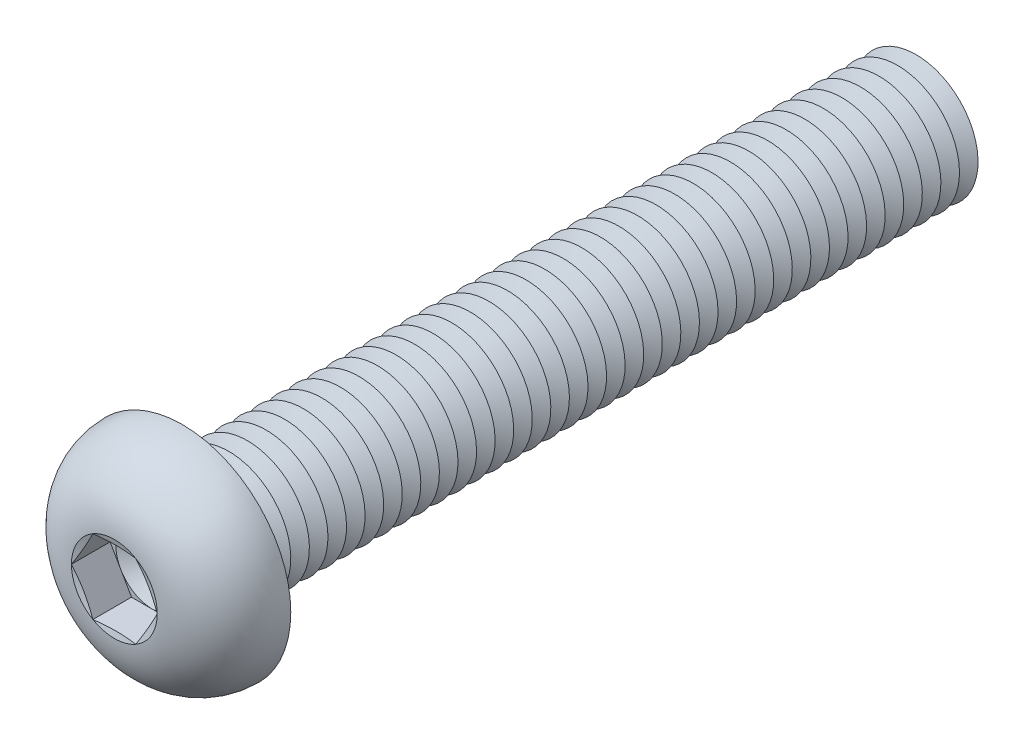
ISO-10303-21;
HEADER;
FILE_DESCRIPTION(('STEP AP214'),'2;1');
FILE_NAME('part.step','',(''),(''),'','','');
FILE_SCHEMA(('AUTOMOTIVE_DESIGN { 1 0 10303 214 1 1 1 1 }'));
ENDSEC;
DATA;
#1=APPLICATION_CONTEXT('core data for automotive mechanical design processes');
#2=APPLICATION_PROTOCOL_DEFINITION('international standard','automotive_design',2000,#1);
#3=PRODUCT_CONTEXT('',#1,'mechanical');
#4=PRODUCT('Part','Part','',(#3));
#5=PRODUCT_RELATED_PRODUCT_CATEGORY('part','',(#4));
#6=PRODUCT_DEFINITION_FORMATION('','',#4);
#7=PRODUCT_DEFINITION_CONTEXT('part definition',#1,'design');
#8=PRODUCT_DEFINITION('design','',#6,#7);
#9=PRODUCT_DEFINITION_SHAPE('','',#8);
#10=(LENGTH_UNIT() NAMED_UNIT(*) SI_UNIT(.MILLI.,.METRE.));
#11=(NAMED_UNIT(*) PLANE_ANGLE_UNIT() SI_UNIT($,.RADIAN.));
#12=(NAMED_UNIT(*) SI_UNIT($,.STERADIAN.) SOLID_ANGLE_UNIT());
#13=UNCERTAINTY_MEASURE_WITH_UNIT(LENGTH_MEASURE(1.E-05),#10,'distance_accuracy_value','');
#14=(GEOMETRIC_REPRESENTATION_CONTEXT(3) GLOBAL_UNCERTAINTY_ASSIGNED_CONTEXT((#13)) GLOBAL_UNIT_ASSIGNED_CONTEXT((#10,
#11,#12)) REPRESENTATION_CONTEXT('',''));
#15=CARTESIAN_POINT('',(0.,0.,0.));
#16=DIRECTION('',(0.,0.,1.));
#17=DIRECTION('',(1.,0.,0.));
#18=AXIS2_PLACEMENT_3D('',#15,#16,#17);
#19=CARTESIAN_POINT('',(0.,0.,2.38));
#20=DIRECTION('',(0.,0.,1.));
#21=DIRECTION('',(1.,0.,0.));
#22=AXIS2_PLACEMENT_3D('',#19,#20,#21);
#23=PLANE('',#22);
#24=CARTESIAN_POINT('',(0.,0.,2.38));
#25=DIRECTION('',(0.,0.,1.));
#26=DIRECTION('',(1.,0.,0.));
#27=AXIS2_PLACEMENT_3D('',#24,#25,#26);
#28=CIRCLE('',#27,2.99999860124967);
#29=CARTESIAN_POINT('',(2.598075,1.49999930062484,2.38));
#30=VERTEX_POINT('',#29);
#31=CARTESIAN_POINT('',(0.,2.99999860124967,2.38));
#32=VERTEX_POINT('',#31);
#33=EDGE_CURVE('E118',#30,#32,#28,.T.);
#34=ORIENTED_EDGE('',*,*,#33,.F.);
#35=DIRECTION('',(-0.500000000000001,0.866025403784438,0.));
#36=VECTOR('',#35,1.);
#37=CARTESIAN_POINT('',(3.4641,0.,2.38));
#38=LINE('',#37,#36);
#39=CARTESIAN_POINT('',(1.73205,2.99999860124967,2.38));
#40=VERTEX_POINT('',#39);
#41=EDGE_CURVE('E125',#30,#40,#38,.T.);
#42=ORIENTED_EDGE('',*,*,#41,.T.);
#43=DIRECTION('',(-1.,0.,0.));
#44=VECTOR('',#43,1.);
#45=CARTESIAN_POINT('',(1.73205,2.99999860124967,2.38));
#46=LINE('',#45,#44);
#47=EDGE_CURVE('E136',#40,#32,#46,.T.);
#48=ORIENTED_EDGE('',*,*,#47,.T.);
#49=EDGE_LOOP('',(#34,#42,#48));
#50=FACE_BOUND('',#49,.T.);
#51=ADVANCED_FACE('F39',(#50),#23,.T.);
#52=CARTESIAN_POINT('',(0.,0.,2.38));
#53=DIRECTION('',(0.,0.,1.));
#54=DIRECTION('',(1.,0.,0.));
#55=AXIS2_PLACEMENT_3D('',#52,#53,#54);
#56=CIRCLE('',#55,2.99999860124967);
#57=CARTESIAN_POINT('',(-2.598075,1.49999930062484,2.38));
#58=VERTEX_POINT('',#57);
#59=EDGE_CURVE('E11',#32,#58,#56,.T.);
#60=ORIENTED_EDGE('',*,*,#59,.F.);
#61=CARTESIAN_POINT('',(-1.73205,2.99999860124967,2.38));
#62=VERTEX_POINT('',#61);
#63=EDGE_CURVE('E131',#32,#62,#46,.T.);
#64=ORIENTED_EDGE('',*,*,#63,.T.);
#65=DIRECTION('',(-0.5,-0.866025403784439,0.));
#66=VECTOR('',#65,1.);
#67=CARTESIAN_POINT('',(-1.73205,2.99999860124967,2.38));
#68=LINE('',#67,#66);
#69=EDGE_CURVE('E134',#62,#58,#68,.T.);
#70=ORIENTED_EDGE('',*,*,#69,.T.);
#71=EDGE_LOOP('',(#60,#64,#70));
#72=FACE_BOUND('',#71,.T.);
#73=ADVANCED_FACE('F130',(#72),#23,.T.);
#74=CARTESIAN_POINT('',(-2.598075,-1.49999930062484,2.38));
#75=VERTEX_POINT('',#74);
#76=EDGE_CURVE('E49',#58,#75,#56,.T.);
#77=ORIENTED_EDGE('',*,*,#76,.F.);
#78=CARTESIAN_POINT('',(-3.4641,0.,2.38));
#79=VERTEX_POINT('',#78);
#80=EDGE_CURVE('E143',#58,#79,#68,.T.);
#81=ORIENTED_EDGE('',*,*,#80,.T.);
#82=DIRECTION('',(0.5,-0.866025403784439,0.));
#83=VECTOR('',#82,1.);
#84=CARTESIAN_POINT('',(-3.4641,0.,2.38));
#85=LINE('',#84,#83);
#86=EDGE_CURVE('E150',#79,#75,#85,.T.);
#87=ORIENTED_EDGE('',*,*,#86,.T.);
#88=EDGE_LOOP('',(#77,#81,#87));
#89=FACE_BOUND('',#88,.T.);
#90=ADVANCED_FACE('F449',(#89),#23,.T.);
#91=CARTESIAN_POINT('',(0.,-2.99999860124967,2.38));
#92=VERTEX_POINT('',#91);
#93=EDGE_CURVE('E432',#75,#92,#56,.T.);
#94=ORIENTED_EDGE('',*,*,#93,.F.);
#95=CARTESIAN_POINT('',(-1.73205,-2.99999860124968,2.38));
#96=VERTEX_POINT('',#95);
#97=EDGE_CURVE('E149',#75,#96,#85,.T.);
#98=ORIENTED_EDGE('',*,*,#97,.T.);
#99=DIRECTION('',(1.,0.,0.));
#100=VECTOR('',#99,1.);
#101=CARTESIAN_POINT('',(-1.73205,-2.99999860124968,2.38));
#102=LINE('',#101,#100);
#103=EDGE_CURVE('E155',#96,#92,#102,.T.);
#104=ORIENTED_EDGE('',*,*,#103,.T.);
#105=EDGE_LOOP('',(#94,#98,#104));
#106=FACE_BOUND('',#105,.T.);
#107=ADVANCED_FACE('F444',(#106),#23,.T.);
#108=CARTESIAN_POINT('',(2.598075,-1.49999930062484,2.38));
#109=VERTEX_POINT('',#108);
#110=EDGE_CURVE('E56',#92,#109,#56,.T.);
#111=ORIENTED_EDGE('',*,*,#110,.F.);
#112=CARTESIAN_POINT('',(1.73205,-2.99999860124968,2.38));
#113=VERTEX_POINT('',#112);
#114=EDGE_CURVE('E154',#92,#113,#102,.T.);
#115=ORIENTED_EDGE('',*,*,#114,.T.);
#116=DIRECTION('',(0.5,0.866025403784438,0.));
#117=VECTOR('',#116,1.);
#118=CARTESIAN_POINT('',(1.73205,-2.99999860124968,2.38));
#119=LINE('',#118,#117);
#120=EDGE_CURVE('E160',#113,#109,#119,.T.);
#121=ORIENTED_EDGE('',*,*,#120,.T.);
#122=EDGE_LOOP('',(#111,#115,#121));
#123=FACE_BOUND('',#122,.T.);
#124=ADVANCED_FACE('F529',(#123),#23,.T.);
#125=CARTESIAN_POINT('',(0.,0.,5.50000000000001));
#126=DIRECTION('',(0.,0.,1.));
#127=DIRECTION('',(0.,-1.,0.));
#128=AXIS2_PLACEMENT_3D('',#125,#126,#127);
#129=CONICAL_SURFACE('',#128,3.4641,1.30899693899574);
#130=CARTESIAN_POINT('',(3.46421547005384,-0.000200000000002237,5.50003094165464));
#131=CARTESIAN_POINT('',(3.39227822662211,0.124398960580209,5.48074619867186));
#132=CARTESIAN_POINT('',(3.32021054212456,0.249223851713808,5.46323875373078));
#133=CARTESIAN_POINT('',(3.17582062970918,0.499314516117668,5.43247971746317));
#134=CARTESIAN_POINT('',(3.10349831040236,0.624580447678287,5.41922985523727));
#135=CARTESIAN_POINT('',(2.95903767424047,0.874793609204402,5.39775958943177));
#136=CARTESIAN_POINT('',(2.88690033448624,0.999739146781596,5.38951357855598));
#137=CARTESIAN_POINT('',(2.74253364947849,1.2497895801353,5.37845651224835));
#138=CARTESIAN_POINT('',(2.67030432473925,1.37489444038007,5.3756444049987));
#139=CARTESIAN_POINT('',(2.52584567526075,1.6251041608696,5.3756444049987));
#140=CARTESIAN_POINT('',(2.45361635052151,1.75020902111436,5.37845651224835));
#141=CARTESIAN_POINT('',(2.30924966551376,2.00025945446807,5.38951357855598));
#142=CARTESIAN_POINT('',(2.23711232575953,2.12520499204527,5.39775958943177));
#143=CARTESIAN_POINT('',(2.09265168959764,2.37541815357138,5.41922985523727));
#144=CARTESIAN_POINT('',(2.02032937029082,2.500684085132,5.43247971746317));
#145=CARTESIAN_POINT('',(1.87593945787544,2.75077474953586,5.46323875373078));
#146=CARTESIAN_POINT('',(1.80387177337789,2.87559964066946,5.48074619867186));
#147=CARTESIAN_POINT('',(1.73193452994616,3.00019860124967,5.50003094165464));
#148=B_SPLINE_CURVE_WITH_KNOTS('',3,(#130,#131,#132,#133,#134,#135,#136,#137,#138,#139,#140,
#141,#142,#143,#144,#145,#146,#147),.UNSPECIFIED.,.F.,.F.,(4,2,2,2,2,2,2,2,4),(0.,
0.435506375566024,0.871189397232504,1.3046235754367,1.7379738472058,2.1713241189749,
2.6047582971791,3.04044131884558,3.4759476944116),.UNSPECIFIED.);
#149=CARTESIAN_POINT('',(3.4641,0.,5.5));
#150=VERTEX_POINT('',#149);
#151=CARTESIAN_POINT('',(1.73204999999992,2.99999860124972,5.50000000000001));
#152=VERTEX_POINT('',#151);
#153=EDGE_CURVE('E226',#150,#152,#148,.T.);
#154=ORIENTED_EDGE('',*,*,#153,.F.);
#155=CARTESIAN_POINT('',(0.,0.,5.50000000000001));
#156=DIRECTION('',(0.,0.,-1.));
#157=DIRECTION('',(0.,1.,0.));
#158=AXIS2_PLACEMENT_3D('',#155,#156,#157);
#159=CIRCLE('',#158,3.4641);
#160=EDGE_CURVE('E305',#152,#150,#159,.T.);
#161=ORIENTED_EDGE('',*,*,#160,.F.);
#162=EDGE_LOOP('',(#154,#161));
#163=FACE_BOUND('',#162,.T.);
#164=ADVANCED_FACE('F465',(#163),#129,.F.);
#165=CARTESIAN_POINT('',(1.73193452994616,-3.00019860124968,5.50003094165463));
#166=CARTESIAN_POINT('',(1.80387177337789,-2.87559964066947,5.48074619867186));
#167=CARTESIAN_POINT('',(1.87593945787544,-2.75077474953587,5.46323875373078));
#168=CARTESIAN_POINT('',(2.02032937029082,-2.50068408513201,5.43247971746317));
#169=CARTESIAN_POINT('',(2.09265168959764,-2.37541815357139,5.41922985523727));
#170=CARTESIAN_POINT('',(2.23711232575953,-2.12520499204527,5.39775958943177));
#171=CARTESIAN_POINT('',(2.30924966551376,-2.00025945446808,5.38951357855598));
#172=CARTESIAN_POINT('',(2.45361635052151,-1.75020902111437,5.37845651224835));
#173=CARTESIAN_POINT('',(2.52584567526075,-1.6251041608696,5.3756444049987));
#174=CARTESIAN_POINT('',(2.67030432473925,-1.37489444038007,5.3756444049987));
#175=CARTESIAN_POINT('',(2.74253364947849,-1.24978958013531,5.37845651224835));
#176=CARTESIAN_POINT('',(2.88690033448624,-0.999739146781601,5.38951357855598));
#177=CARTESIAN_POINT('',(2.95903767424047,-0.874793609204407,5.39775958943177));
#178=CARTESIAN_POINT('',(3.10349831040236,-0.624580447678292,5.41922985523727));
#179=CARTESIAN_POINT('',(3.17582062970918,-0.499314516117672,5.43247971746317));
#180=CARTESIAN_POINT('',(3.32021054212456,-0.249223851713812,5.46323875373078));
#181=CARTESIAN_POINT('',(3.39227822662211,-0.124398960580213,5.48074619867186));
#182=CARTESIAN_POINT('',(3.46421547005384,0.00019999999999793,5.50003094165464));
#183=B_SPLINE_CURVE_WITH_KNOTS('',3,(#165,#166,#167,#168,#169,#170,#171,#172,#173,#174,#175,
#176,#177,#178,#179,#180,#181,#182),.UNSPECIFIED.,.F.,.F.,(4,2,2,2,2,2,2,2,4),(0.,
0.435506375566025,0.871189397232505,1.3046235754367,1.7379738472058,2.1713241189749,
2.6047582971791,3.04044131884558,3.4759476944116),.UNSPECIFIED.);
#184=CARTESIAN_POINT('',(1.73205,-2.99999860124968,5.5));
#185=VERTEX_POINT('',#184);
#186=EDGE_CURVE('E229',#185,#150,#183,.T.);
#187=ORIENTED_EDGE('',*,*,#186,.F.);
#188=EDGE_CURVE('E288',#150,#185,#159,.T.);
#189=ORIENTED_EDGE('',*,*,#188,.F.);
#190=EDGE_LOOP('',(#187,#189));
#191=FACE_BOUND('',#190,.T.);
#192=ADVANCED_FACE('F286',(#191),#129,.F.);
#193=CARTESIAN_POINT('',(-5.2273006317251,-2.99999860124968,6.18672552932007));
#194=CARTESIAN_POINT('',(-5.10075887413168,-2.99999860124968,6.15732018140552));
#195=CARTESIAN_POINT('',(-4.97415993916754,-2.99999860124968,6.12816064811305));
#196=CARTESIAN_POINT('',(-4.72082394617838,-2.99999860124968,6.07043857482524));
#197=CARTESIAN_POINT('',(-4.59408688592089,-2.99999860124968,6.04187604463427));
#198=CARTESIAN_POINT('',(-4.21358997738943,-2.99999860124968,5.95723252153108));
#199=CARTESIAN_POINT('',(-3.95959339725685,-2.99999860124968,5.90220706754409));
#200=CARTESIAN_POINT('',(-3.44835573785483,-2.99999860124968,5.79574115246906));
#201=CARTESIAN_POINT('',(-3.19110656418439,-2.99999860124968,5.74433913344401));
#202=CARTESIAN_POINT('',(-2.67540790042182,-2.99999860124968,5.6477299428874));
#203=CARTESIAN_POINT('',(-2.41695830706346,-2.99999860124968,5.60252331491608));
#204=CARTESIAN_POINT('',(-1.9055512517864,-2.99999860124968,5.52251897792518));
#205=CARTESIAN_POINT('',(-1.65263426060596,-2.99999860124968,5.48747285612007));
#206=CARTESIAN_POINT('',(-1.27220564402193,-2.99999860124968,5.4443960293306));
#207=CARTESIAN_POINT('',(-1.1452320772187,-2.99999860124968,5.43161987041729));
#208=CARTESIAN_POINT('',(-0.890973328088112,-2.99999860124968,5.40972605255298));
#209=CARTESIAN_POINT('',(-0.76368816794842,-2.99999860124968,5.40060814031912));
#210=CARTESIAN_POINT('',(-0.50944206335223,-2.99999860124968,5.38647457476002));
#211=CARTESIAN_POINT('',(-0.382482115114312,-2.99999860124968,5.38144125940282));
#212=CARTESIAN_POINT('',(-0.128463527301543,-2.99999860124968,5.37566637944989));
#213=CARTESIAN_POINT('',(-0.00140488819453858,-2.99999860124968,5.37492479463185));
#214=CARTESIAN_POINT('',(0.252672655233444,-2.99999860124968,5.37777315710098));
#215=CARTESIAN_POINT('',(0.379691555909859,-2.99999860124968,5.38136342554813));
#216=CARTESIAN_POINT('',(0.633540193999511,-2.99999860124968,5.39268816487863));
#217=CARTESIAN_POINT('',(0.760369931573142,-2.99999860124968,5.40042263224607));
#218=CARTESIAN_POINT('',(1.06836981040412,-2.99999860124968,5.42382465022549));
#219=CARTESIAN_POINT('',(1.24938929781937,-2.99999860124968,5.44147485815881));
#220=CARTESIAN_POINT('',(1.61066786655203,-2.99999860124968,5.48312309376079));
#221=CARTESIAN_POINT('',(1.7909269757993,-2.99999860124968,5.50712088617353));
#222=CARTESIAN_POINT('',(2.15127612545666,-2.99999860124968,5.56013471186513));
#223=CARTESIAN_POINT('',(2.33136383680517,-2.99999860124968,5.58916634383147));
#224=CARTESIAN_POINT('',(2.690892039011,-2.99999860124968,5.65100028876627));
#225=CARTESIAN_POINT('',(2.87033249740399,-2.99999860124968,5.68380278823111));
#226=CARTESIAN_POINT('',(3.23235399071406,-2.99999860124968,5.75295369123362));
#227=CARTESIAN_POINT('',(3.4149236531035,-2.99999860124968,5.78936117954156));
#228=CARTESIAN_POINT('',(3.77960351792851,-2.99999860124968,5.86440648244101));
#229=CARTESIAN_POINT('',(3.96171371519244,-2.99999860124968,5.90304432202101));
#230=CARTESIAN_POINT('',(4.32457472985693,-2.99999860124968,5.98179660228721));
#231=CARTESIAN_POINT('',(4.5053275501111,-2.99999860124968,6.02190185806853));
#232=CARTESIAN_POINT('',(4.86652484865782,-2.99999860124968,6.10342152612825));
#233=CARTESIAN_POINT('',(5.04696934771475,-2.99999860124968,6.14483584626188));
#234=CARTESIAN_POINT('',(5.22730063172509,-2.99999860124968,6.18672552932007));
#235=B_SPLINE_CURVE_WITH_KNOTS('',3,(#193,#194,#195,#196,#197,#198,#199,#200,#201,#202,#203,
#204,#205,#206,#207,#208,#209,#210,#211,#212,#213,#214,#215,#216,#217,#218,#219,#220,#221,#222,
#223,#224,#225,#226,#227,#228,#229,#230,#231,#232,#233,#234),.UNSPECIFIED.,.F.,.F.,(4,2,2,2,2,2,
2,2,2,2,2,2,2,2,2,2,2,2,2,2,4),(0.,0.389739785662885,0.779485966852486,1.5591292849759,
2.34608117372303,3.13310206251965,3.8988410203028,4.28164148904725,4.66441544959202,
5.04552531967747,5.42663339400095,5.80776972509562,6.18890573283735,6.73438998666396,
7.27985402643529,7.8270395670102,8.37425218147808,8.93272720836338,9.49120849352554,
10.0466490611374,10.6020506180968),.UNSPECIFIED.);
#236=CARTESIAN_POINT('',(-1.73205,-2.99999860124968,5.5));
#237=VERTEX_POINT('',#236);
#238=EDGE_CURVE('E239',#237,#185,#235,.T.);
#239=ORIENTED_EDGE('',*,*,#238,.F.);
#240=EDGE_CURVE('E293',#185,#237,#159,.T.);
#241=ORIENTED_EDGE('',*,*,#240,.F.);
#242=EDGE_LOOP('',(#239,#241));
#243=FACE_BOUND('',#242,.T.);
#244=ADVANCED_FACE('F294',(#243),#129,.F.);
#245=CARTESIAN_POINT('',(-3.46421547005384,0.00019999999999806,5.50003094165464));
#246=CARTESIAN_POINT('',(-3.39227822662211,-0.124398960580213,5.48074619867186));
#247=CARTESIAN_POINT('',(-3.32021054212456,-0.249223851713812,5.46323875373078));
#248=CARTESIAN_POINT('',(-3.17582062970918,-0.499314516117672,5.43247971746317));
#249=CARTESIAN_POINT('',(-3.10349831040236,-0.624580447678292,5.41922985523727));
#250=CARTESIAN_POINT('',(-2.95903767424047,-0.874793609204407,5.39775958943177));
#251=CARTESIAN_POINT('',(-2.88690033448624,-0.999739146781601,5.38951357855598));
#252=CARTESIAN_POINT('',(-2.74253364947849,-1.24978958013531,5.37845651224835));
#253=CARTESIAN_POINT('',(-2.67030432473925,-1.37489444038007,5.3756444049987));
#254=CARTESIAN_POINT('',(-2.52584567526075,-1.6251041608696,5.3756444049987));
#255=CARTESIAN_POINT('',(-2.45361635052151,-1.75020902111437,5.37845651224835));
#256=CARTESIAN_POINT('',(-2.30924966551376,-2.00025945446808,5.38951357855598));
#257=CARTESIAN_POINT('',(-2.23711232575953,-2.12520499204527,5.39775958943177));
#258=CARTESIAN_POINT('',(-2.09265168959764,-2.37541815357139,5.41922985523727));
#259=CARTESIAN_POINT('',(-2.02032937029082,-2.50068408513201,5.43247971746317));
#260=CARTESIAN_POINT('',(-1.87593945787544,-2.75077474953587,5.46323875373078));
#261=CARTESIAN_POINT('',(-1.80387177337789,-2.87559964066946,5.48074619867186));
#262=CARTESIAN_POINT('',(-1.73193452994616,-3.00019860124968,5.50003094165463));
#263=B_SPLINE_CURVE_WITH_KNOTS('',3,(#245,#246,#247,#248,#249,#250,#251,#252,#253,#254,#255,
#256,#257,#258,#259,#260,#261,#262),.UNSPECIFIED.,.F.,.F.,(4,2,2,2,2,2,2,2,4),(0.,
0.435506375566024,0.871189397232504,1.3046235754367,1.7379738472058,2.1713241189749,
2.6047582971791,3.04044131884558,3.4759476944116),.UNSPECIFIED.);
#264=CARTESIAN_POINT('',(-3.4641,0.,5.5));
#265=VERTEX_POINT('',#264);
#266=EDGE_CURVE('E234',#265,#237,#263,.T.);
#267=ORIENTED_EDGE('',*,*,#266,.F.);
#268=EDGE_CURVE('E299',#237,#265,#159,.T.);
#269=ORIENTED_EDGE('',*,*,#268,.F.);
#270=EDGE_LOOP('',(#267,#269));
#271=FACE_BOUND('',#270,.T.);
#272=ADVANCED_FACE('F456',(#271),#129,.F.);
#273=CARTESIAN_POINT('',(-1.73193452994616,3.00019860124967,5.50003094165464));
#274=CARTESIAN_POINT('',(-1.8038717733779,2.87559964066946,5.48074619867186));
#275=CARTESIAN_POINT('',(-1.87593945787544,2.75077474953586,5.46323875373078));
#276=CARTESIAN_POINT('',(-2.02032937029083,2.500684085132,5.43247971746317));
#277=CARTESIAN_POINT('',(-2.09265168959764,2.37541815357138,5.41922985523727));
#278=CARTESIAN_POINT('',(-2.23711232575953,2.12520499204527,5.39775958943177));
#279=CARTESIAN_POINT('',(-2.30924966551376,2.00025945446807,5.38951357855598));
#280=CARTESIAN_POINT('',(-2.45361635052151,1.75020902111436,5.37845651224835));
#281=CARTESIAN_POINT('',(-2.52584567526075,1.6251041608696,5.3756444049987));
#282=CARTESIAN_POINT('',(-2.67030432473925,1.37489444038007,5.3756444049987));
#283=CARTESIAN_POINT('',(-2.74253364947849,1.2497895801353,5.37845651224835));
#284=CARTESIAN_POINT('',(-2.88690033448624,0.999739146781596,5.38951357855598));
#285=CARTESIAN_POINT('',(-2.95903767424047,0.874793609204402,5.39775958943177));
#286=CARTESIAN_POINT('',(-3.10349831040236,0.624580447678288,5.41922985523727));
#287=CARTESIAN_POINT('',(-3.17582062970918,0.499314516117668,5.43247971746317));
#288=CARTESIAN_POINT('',(-3.32021054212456,0.249223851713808,5.46323875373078));
#289=CARTESIAN_POINT('',(-3.39227822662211,0.124398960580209,5.48074619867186));
#290=CARTESIAN_POINT('',(-3.46421547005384,-0.000200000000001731,5.50003094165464));
#291=B_SPLINE_CURVE_WITH_KNOTS('',3,(#273,#274,#275,#276,#277,#278,#279,#280,#281,#282,#283,
#284,#285,#286,#287,#288,#289,#290),.UNSPECIFIED.,.F.,.F.,(4,2,2,2,2,2,2,2,4),(0.,
0.435506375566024,0.871189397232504,1.3046235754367,1.7379738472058,2.1713241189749,
2.6047582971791,3.04044131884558,3.4759476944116),.UNSPECIFIED.);
#292=CARTESIAN_POINT('',(-1.73205,2.99999860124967,5.5));
#293=VERTEX_POINT('',#292);
#294=EDGE_CURVE('E231',#293,#265,#291,.T.);
#295=ORIENTED_EDGE('',*,*,#294,.F.);
#296=EDGE_CURVE('E318',#265,#293,#159,.T.);
#297=ORIENTED_EDGE('',*,*,#296,.F.);
#298=EDGE_LOOP('',(#295,#297));
#299=FACE_BOUND('',#298,.T.);
#300=ADVANCED_FACE('F459',(#299),#129,.F.);
#301=CARTESIAN_POINT('',(0.,0.,-54.75));
#302=DIRECTION('',(0.,0.,1.));
#303=DIRECTION('',(0.,-1.,0.));
#304=AXIS2_PLACEMENT_3D('',#301,#302,#303);
#305=CONICAL_SURFACE('',#304,4.99999999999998,1.0471975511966);
#306=CARTESIAN_POINT('',(0.,0.,-55.5));
#307=DIRECTION('',(0.,0.,1.));
#308=DIRECTION('',(0.,-1.,0.));
#309=AXIS2_PLACEMENT_3D('',#306,#307,#308);
#310=CIRCLE('',#309,3.70096189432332);
#311=CARTESIAN_POINT('',(0.,-3.70096189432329,-55.5));
#312=VERTEX_POINT('',#311);
#313=EDGE_CURVE('E410',#312,#312,#310,.T.);
#314=ORIENTED_EDGE('',*,*,#313,.T.);
#315=EDGE_LOOP('',(#314));
#316=FACE_BOUND('',#315,.T.);
#317=CARTESIAN_POINT('',(0.,0.,-54.75));
#318=DIRECTION('',(0.,0.,1.));
#319=DIRECTION('',(0.,-1.,0.));
#320=AXIS2_PLACEMENT_3D('',#317,#318,#319);
#321=CIRCLE('',#320,4.99999999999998);
#322=CARTESIAN_POINT('',(0.,-4.99999999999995,-54.75));
#323=VERTEX_POINT('',#322);
#324=EDGE_CURVE('E494',#323,#323,#321,.T.);
#325=ORIENTED_EDGE('',*,*,#324,.F.);
#326=EDGE_LOOP('',(#325));
#327=FACE_BOUND('',#326,.T.);
#328=ADVANCED_FACE('F507',(#316,#327),#305,.T.);
#329=CARTESIAN_POINT('',(0.,0.,-55.5));
#330=DIRECTION('',(0.,0.,-1.));
#331=DIRECTION('',(0.,1.,0.));
#332=AXIS2_PLACEMENT_3D('',#329,#330,#331);
#333=CONICAL_SURFACE('',#332,3.70096189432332,1.0471975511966);
#334=CARTESIAN_POINT('',(0.,0.,-56.25));
#335=DIRECTION('',(0.,0.,1.));
#336=DIRECTION('',(0.,-1.,0.));
#337=AXIS2_PLACEMENT_3D('',#334,#335,#336);
#338=CIRCLE('',#337,4.99999999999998);
#339=CARTESIAN_POINT('',(0.,-4.99999999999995,-56.25));
#340=VERTEX_POINT('',#339);
#341=EDGE_CURVE('E401',#340,#340,#338,.T.);
#342=ORIENTED_EDGE('',*,*,#341,.T.);
#343=EDGE_LOOP('',(#342));
#344=FACE_BOUND('',#343,.T.);
#345=ORIENTED_EDGE('',*,*,#313,.F.);
#346=EDGE_LOOP('',(#345));
#347=FACE_BOUND('',#346,.T.);
#348=ADVANCED_FACE('F510',(#344,#347),#333,.T.);
#349=CARTESIAN_POINT('',(0.,4.99999999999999,-60.));
#350=DIRECTION('',(0.,0.,-1.));
#351=DIRECTION('',(0.,1.,0.));
#352=AXIS2_PLACEMENT_3D('',#349,#350,#351);
#353=PLANE('',#352);
#354=CARTESIAN_POINT('',(0.,0.,-60.));
#355=DIRECTION('',(0.,0.,1.));
#356=DIRECTION('',(0.,-1.,0.));
#357=AXIS2_PLACEMENT_3D('',#354,#355,#356);
#358=CIRCLE('',#357,3.70096189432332);
#359=CARTESIAN_POINT('',(0.,-3.70096189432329,-60.));
#360=VERTEX_POINT('',#359);
#361=EDGE_CURVE('E325',#360,#360,#358,.T.);
#362=ORIENTED_EDGE('',*,*,#361,.F.);
#363=EDGE_LOOP('',(#362));
#364=FACE_BOUND('',#363,.T.);
#365=ADVANCED_FACE('F512',(#364),#353,.T.);
#366=CARTESIAN_POINT('',(0.,0.,-59.25));
#367=DIRECTION('',(0.,0.,1.));
#368=DIRECTION('',(0.,-1.,0.));
#369=AXIS2_PLACEMENT_3D('',#366,#367,#368);
#370=CONICAL_SURFACE('',#369,4.99999999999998,1.0471975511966);
#371=ORIENTED_EDGE('',*,*,#361,.T.);
#372=EDGE_LOOP('',(#371));
#373=FACE_BOUND('',#372,.T.);
#374=CARTESIAN_POINT('',(0.,0.,-59.25));
#375=DIRECTION('',(0.,0.,1.));
#376=DIRECTION('',(0.,-1.,0.));
#377=AXIS2_PLACEMENT_3D('',#374,#375,#376);
#378=CIRCLE('',#377,4.99999999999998);
#379=CARTESIAN_POINT('',(0.,-4.99999999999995,-59.25));
#380=VERTEX_POINT('',#379);
#381=EDGE_CURVE('E366',#380,#380,#378,.T.);
#382=ORIENTED_EDGE('',*,*,#381,.F.);
#383=EDGE_LOOP('',(#382));
#384=FACE_BOUND('',#383,.T.);
#385=ADVANCED_FACE('F519',(#373,#384),#370,.T.);
#386=CARTESIAN_POINT('',(0.,0.,-58.5));
#387=DIRECTION('',(0.,0.,-1.));
#388=DIRECTION('',(0.,1.,0.));
#389=AXIS2_PLACEMENT_3D('',#386,#387,#388);
#390=CONICAL_SURFACE('',#389,3.70096189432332,1.0471975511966);
#391=ORIENTED_EDGE('',*,*,#381,.T.);
#392=EDGE_LOOP('',(#391));
#393=FACE_BOUND('',#392,.T.);
#394=CARTESIAN_POINT('',(0.,0.,-58.5));
#395=DIRECTION('',(0.,0.,1.));
#396=DIRECTION('',(0.,-1.,0.));
#397=AXIS2_PLACEMENT_3D('',#394,#395,#396);
#398=CIRCLE('',#397,3.70096189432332);
#399=CARTESIAN_POINT('',(0.,-3.70096189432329,-58.5));
#400=VERTEX_POINT('',#399);
#401=EDGE_CURVE('E364',#400,#400,#398,.T.);
#402=ORIENTED_EDGE('',*,*,#401,.F.);
#403=EDGE_LOOP('',(#402));
#404=FACE_BOUND('',#403,.T.);
#405=ADVANCED_FACE('F749',(#393,#404),#390,.T.);
#406=CARTESIAN_POINT('',(0.,0.,-57.75));
#407=DIRECTION('',(0.,0.,1.));
#408=DIRECTION('',(0.,-1.,0.));
#409=AXIS2_PLACEMENT_3D('',#406,#407,#408);
#410=CONICAL_SURFACE('',#409,4.99999999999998,1.0471975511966);
#411=ORIENTED_EDGE('',*,*,#401,.T.);
#412=EDGE_LOOP('',(#411));
#413=FACE_BOUND('',#412,.T.);
#414=CARTESIAN_POINT('',(0.,0.,-57.75));
#415=DIRECTION('',(0.,0.,1.));
#416=DIRECTION('',(0.,-1.,0.));
#417=AXIS2_PLACEMENT_3D('',#414,#415,#416);
#418=CIRCLE('',#417,4.99999999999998);
#419=CARTESIAN_POINT('',(0.,-4.99999999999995,-57.75));
#420=VERTEX_POINT('',#419);
#421=EDGE_CURVE('E367',#420,#420,#418,.T.);
#422=ORIENTED_EDGE('',*,*,#421,.F.);
#423=EDGE_LOOP('',(#422));
#424=FACE_BOUND('',#423,.T.);
#425=ADVANCED_FACE('F744',(#413,#424),#410,.T.);
#426=CARTESIAN_POINT('',(0.,0.,-57.));
#427=DIRECTION('',(0.,0.,-1.));
#428=DIRECTION('',(0.,1.,0.));
#429=AXIS2_PLACEMENT_3D('',#426,#427,#428);
#430=CONICAL_SURFACE('',#429,3.70096189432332,1.0471975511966);
#431=ORIENTED_EDGE('',*,*,#421,.T.);
#432=EDGE_LOOP('',(#431));
#433=FACE_BOUND('',#432,.T.);
#434=CARTESIAN_POINT('',(0.,0.,-57.));
#435=DIRECTION('',(0.,0.,1.));
#436=DIRECTION('',(0.,-1.,0.));
#437=AXIS2_PLACEMENT_3D('',#434,#435,#436);
#438=CIRCLE('',#437,3.70096189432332);
#439=CARTESIAN_POINT('',(0.,-3.70096189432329,-57.));
#440=VERTEX_POINT('',#439);
#441=EDGE_CURVE('E399',#440,#440,#438,.T.);
#442=ORIENTED_EDGE('',*,*,#441,.F.);
#443=EDGE_LOOP('',(#442));
#444=FACE_BOUND('',#443,.T.);
#445=ADVANCED_FACE('F737',(#433,#444),#430,.T.);
#446=CARTESIAN_POINT('',(0.,0.,-56.25));
#447=DIRECTION('',(0.,0.,1.));
#448=DIRECTION('',(0.,-1.,0.));
#449=AXIS2_PLACEMENT_3D('',#446,#447,#448);
#450=CONICAL_SURFACE('',#449,4.99999999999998,1.0471975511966);
#451=ORIENTED_EDGE('',*,*,#441,.T.);
#452=EDGE_LOOP('',(#451));
#453=FACE_BOUND('',#452,.T.);
#454=ORIENTED_EDGE('',*,*,#341,.F.);
#455=EDGE_LOOP('',(#454));
#456=FACE_BOUND('',#455,.T.);
#457=ADVANCED_FACE('F733',(#453,#456),#450,.T.);
#458=CARTESIAN_POINT('',(0.,0.,-53.25));
#459=DIRECTION('',(0.,0.,1.));
#460=DIRECTION('',(0.,-1.,0.));
#461=AXIS2_PLACEMENT_3D('',#458,#459,#460);
#462=CONICAL_SURFACE('',#461,4.99999999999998,1.0471975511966);
#463=CARTESIAN_POINT('',(0.,0.,-54.));
#464=DIRECTION('',(0.,0.,1.));
#465=DIRECTION('',(0.,-1.,0.));
#466=AXIS2_PLACEMENT_3D('',#463,#464,#465);
#467=CIRCLE('',#466,3.70096189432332);
#468=CARTESIAN_POINT('',(0.,-3.70096189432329,-54.));
#469=VERTEX_POINT('',#468);
#470=EDGE_CURVE('E356',#469,#469,#467,.T.);
#471=ORIENTED_EDGE('',*,*,#470,.T.);
#472=EDGE_LOOP('',(#471));
#473=FACE_BOUND('',#472,.T.);
#474=CARTESIAN_POINT('',(0.,0.,-53.25));
#475=DIRECTION('',(0.,0.,1.));
#476=DIRECTION('',(0.,-1.,0.));
#477=AXIS2_PLACEMENT_3D('',#474,#475,#476);
#478=CIRCLE('',#477,4.99999999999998);
#479=CARTESIAN_POINT('',(0.,-4.99999999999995,-53.25));
#480=VERTEX_POINT('',#479);
#481=EDGE_CURVE('E354',#480,#480,#478,.T.);
#482=ORIENTED_EDGE('',*,*,#481,.F.);
#483=EDGE_LOOP('',(#482));
#484=FACE_BOUND('',#483,.T.);
#485=ADVANCED_FACE('F730',(#473,#484),#462,.T.);
#486=CARTESIAN_POINT('',(0.,0.,-54.));
#487=DIRECTION('',(0.,0.,-1.));
#488=DIRECTION('',(0.,1.,0.));
#489=AXIS2_PLACEMENT_3D('',#486,#487,#488);
#490=CONICAL_SURFACE('',#489,3.70096189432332,1.0471975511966);
#491=ORIENTED_EDGE('',*,*,#324,.T.);
#492=EDGE_LOOP('',(#491));
#493=FACE_BOUND('',#492,.T.);
#494=ORIENTED_EDGE('',*,*,#470,.F.);
#495=EDGE_LOOP('',(#494));
#496=FACE_BOUND('',#495,.T.);
#497=ADVANCED_FACE('F725',(#493,#496),#490,.T.);
#498=CARTESIAN_POINT('',(0.,0.,-51.75));
#499=DIRECTION('',(0.,0.,1.));
#500=DIRECTION('',(0.,-1.,0.));
#501=AXIS2_PLACEMENT_3D('',#498,#499,#500);
#502=CONICAL_SURFACE('',#501,4.99999999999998,1.0471975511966);
#503=CARTESIAN_POINT('',(0.,0.,-52.5));
#504=DIRECTION('',(0.,0.,1.));
#505=DIRECTION('',(0.,-1.,0.));
#506=AXIS2_PLACEMENT_3D('',#503,#504,#505);
#507=CIRCLE('',#506,3.70096189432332);
#508=CARTESIAN_POINT('',(0.,-3.70096189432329,-52.5));
#509=VERTEX_POINT('',#508);
#510=EDGE_CURVE('E357',#509,#509,#507,.T.);
#511=ORIENTED_EDGE('',*,*,#510,.T.);
#512=EDGE_LOOP('',(#511));
#513=FACE_BOUND('',#512,.T.);
#514=CARTESIAN_POINT('',(0.,0.,-51.75));
#515=DIRECTION('',(0.,0.,1.));
#516=DIRECTION('',(0.,-1.,0.));
#517=AXIS2_PLACEMENT_3D('',#514,#515,#516);
#518=CIRCLE('',#517,4.99999999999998);
#519=CARTESIAN_POINT('',(0.,-4.99999999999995,-51.75));
#520=VERTEX_POINT('',#519);
#521=EDGE_CURVE('E539',#520,#520,#518,.T.);
#522=ORIENTED_EDGE('',*,*,#521,.F.);
#523=EDGE_LOOP('',(#522));
#524=FACE_BOUND('',#523,.T.);
#525=ADVANCED_FACE('F710',(#513,#524),#502,.T.);
#526=CARTESIAN_POINT('',(0.,0.,-52.5));
#527=DIRECTION('',(0.,0.,-1.));
#528=DIRECTION('',(0.,1.,0.));
#529=AXIS2_PLACEMENT_3D('',#526,#527,#528);
#530=CONICAL_SURFACE('',#529,3.70096189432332,1.0471975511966);
#531=ORIENTED_EDGE('',*,*,#481,.T.);
#532=EDGE_LOOP('',(#531));
#533=FACE_BOUND('',#532,.T.);
#534=ORIENTED_EDGE('',*,*,#510,.F.);
#535=EDGE_LOOP('',(#534));
#536=FACE_BOUND('',#535,.T.);
#537=ADVANCED_FACE('F713',(#533,#536),#530,.T.);
#538=CARTESIAN_POINT('',(0.,0.,-50.25));
#539=DIRECTION('',(0.,0.,1.));
#540=DIRECTION('',(0.,-1.,0.));
#541=AXIS2_PLACEMENT_3D('',#538,#539,#540);
#542=CONICAL_SURFACE('',#541,4.99999999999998,1.0471975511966);
#543=CARTESIAN_POINT('',(0.,0.,-51.));
#544=DIRECTION('',(0.,0.,1.));
#545=DIRECTION('',(0.,-1.,0.));
#546=AXIS2_PLACEMENT_3D('',#543,#544,#545);
#547=CIRCLE('',#546,3.70096189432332);
#548=CARTESIAN_POINT('',(0.,-3.70096189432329,-51.));
#549=VERTEX_POINT('',#548);
#550=EDGE_CURVE('E542',#549,#549,#547,.T.);
#551=ORIENTED_EDGE('',*,*,#550,.T.);
#552=EDGE_LOOP('',(#551));
#553=FACE_BOUND('',#552,.T.);
#554=CARTESIAN_POINT('',(0.,0.,-50.25));
#555=DIRECTION('',(0.,0.,1.));
#556=DIRECTION('',(0.,-1.,0.));
#557=AXIS2_PLACEMENT_3D('',#554,#555,#556);
#558=CIRCLE('',#557,4.99999999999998);
#559=CARTESIAN_POINT('',(0.,-4.99999999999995,-50.25));
#560=VERTEX_POINT('',#559);
#561=EDGE_CURVE('E491',#560,#560,#558,.T.);
#562=ORIENTED_EDGE('',*,*,#561,.F.);
#563=EDGE_LOOP('',(#562));
#564=FACE_BOUND('',#563,.T.);
#565=ADVANCED_FACE('F715',(#553,#564),#542,.T.);
#566=CARTESIAN_POINT('',(0.,0.,-51.));
#567=DIRECTION('',(0.,0.,-1.));
#568=DIRECTION('',(0.,1.,0.));
#569=AXIS2_PLACEMENT_3D('',#566,#567,#568);
#570=CONICAL_SURFACE('',#569,3.70096189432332,1.0471975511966);
#571=ORIENTED_EDGE('',*,*,#521,.T.);
#572=EDGE_LOOP('',(#571));
#573=FACE_BOUND('',#572,.T.);
#574=ORIENTED_EDGE('',*,*,#550,.F.);
#575=EDGE_LOOP('',(#574));
#576=FACE_BOUND('',#575,.T.);
#577=ADVANCED_FACE('F722',(#573,#576),#570,.T.);
#578=CARTESIAN_POINT('',(0.,0.,-48.75));
#579=DIRECTION('',(0.,0.,1.));
#580=DIRECTION('',(0.,-1.,0.));
#581=AXIS2_PLACEMENT_3D('',#578,#579,#580);
#582=CONICAL_SURFACE('',#581,4.99999999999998,1.0471975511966);
#583=CARTESIAN_POINT('',(0.,0.,-49.5));
#584=DIRECTION('',(0.,0.,1.));
#585=DIRECTION('',(0.,-1.,0.));
#586=AXIS2_PLACEMENT_3D('',#583,#584,#585);
#587=CIRCLE('',#586,3.70096189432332);
#588=CARTESIAN_POINT('',(0.,-3.7009618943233,-49.5));
#589=VERTEX_POINT('',#588);
#590=EDGE_CURVE('E396',#589,#589,#587,.T.);
#591=ORIENTED_EDGE('',*,*,#590,.T.);
#592=EDGE_LOOP('',(#591));
#593=FACE_BOUND('',#592,.T.);
#594=CARTESIAN_POINT('',(0.,0.,-48.75));
#595=DIRECTION('',(0.,0.,1.));
#596=DIRECTION('',(0.,-1.,0.));
#597=AXIS2_PLACEMENT_3D('',#594,#595,#596);
#598=CIRCLE('',#597,4.99999999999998);
#599=CARTESIAN_POINT('',(0.,-4.99999999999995,-48.75));
#600=VERTEX_POINT('',#599);
#601=EDGE_CURVE('E394',#600,#600,#598,.T.);
#602=ORIENTED_EDGE('',*,*,#601,.F.);
#603=EDGE_LOOP('',(#602));
#604=FACE_BOUND('',#603,.T.);
#605=ADVANCED_FACE('F810',(#593,#604),#582,.T.);
#606=CARTESIAN_POINT('',(0.,0.,-49.5));
#607=DIRECTION('',(0.,0.,-1.));
#608=DIRECTION('',(0.,1.,0.));
#609=AXIS2_PLACEMENT_3D('',#606,#607,#608);
#610=CONICAL_SURFACE('',#609,3.70096189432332,1.0471975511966);
#611=ORIENTED_EDGE('',*,*,#561,.T.);
#612=EDGE_LOOP('',(#611));
#613=FACE_BOUND('',#612,.T.);
#614=ORIENTED_EDGE('',*,*,#590,.F.);
#615=EDGE_LOOP('',(#614));
#616=FACE_BOUND('',#615,.T.);
#617=ADVANCED_FACE('F818',(#613,#616),#610,.T.);
#618=CARTESIAN_POINT('',(0.,0.,-47.25));
#619=DIRECTION('',(0.,0.,1.));
#620=DIRECTION('',(0.,-1.,0.));
#621=AXIS2_PLACEMENT_3D('',#618,#619,#620);
#622=CONICAL_SURFACE('',#621,4.99999999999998,1.0471975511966);
#623=CARTESIAN_POINT('',(0.,0.,-48.));
#624=DIRECTION('',(0.,0.,1.));
#625=DIRECTION('',(0.,-1.,0.));
#626=AXIS2_PLACEMENT_3D('',#623,#624,#625);
#627=CIRCLE('',#626,3.70096189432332);
#628=CARTESIAN_POINT('',(0.,-3.7009618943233,-48.));
#629=VERTEX_POINT('',#628);
#630=EDGE_CURVE('E397',#629,#629,#627,.T.);
#631=ORIENTED_EDGE('',*,*,#630,.T.);
#632=EDGE_LOOP('',(#631));
#633=FACE_BOUND('',#632,.T.);
#634=CARTESIAN_POINT('',(0.,0.,-47.25));
#635=DIRECTION('',(0.,0.,1.));
#636=DIRECTION('',(0.,-1.,0.));
#637=AXIS2_PLACEMENT_3D('',#634,#635,#636);
#638=CIRCLE('',#637,4.99999999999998);
#639=CARTESIAN_POINT('',(0.,-4.99999999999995,-47.25));
#640=VERTEX_POINT('',#639);
#641=EDGE_CURVE('E694',#640,#640,#638,.T.);
#642=ORIENTED_EDGE('',*,*,#641,.F.);
#643=EDGE_LOOP('',(#642));
#644=FACE_BOUND('',#643,.T.);
#645=ADVANCED_FACE('F827',(#633,#644),#622,.T.);
#646=CARTESIAN_POINT('',(0.,0.,-48.));
#647=DIRECTION('',(0.,0.,-1.));
#648=DIRECTION('',(0.,1.,0.));
#649=AXIS2_PLACEMENT_3D('',#646,#647,#648);
#650=CONICAL_SURFACE('',#649,3.70096189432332,1.0471975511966);
#651=ORIENTED_EDGE('',*,*,#601,.T.);
#652=EDGE_LOOP('',(#651));
#653=FACE_BOUND('',#652,.T.);
#654=ORIENTED_EDGE('',*,*,#630,.F.);
#655=EDGE_LOOP('',(#654));
#656=FACE_BOUND('',#655,.T.);
#657=ADVANCED_FACE('F836',(#653,#656),#650,.T.);
#658=CARTESIAN_POINT('',(0.,0.,-45.75));
#659=DIRECTION('',(0.,0.,1.));
#660=DIRECTION('',(0.,-1.,0.));
#661=AXIS2_PLACEMENT_3D('',#658,#659,#660);
#662=CONICAL_SURFACE('',#661,4.99999999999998,1.0471975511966);
#663=CARTESIAN_POINT('',(0.,0.,-46.5));
#664=DIRECTION('',(0.,0.,1.));
#665=DIRECTION('',(0.,-1.,0.));
#666=AXIS2_PLACEMENT_3D('',#663,#664,#665);
#667=CIRCLE('',#666,3.70096189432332);
#668=CARTESIAN_POINT('',(0.,-3.7009618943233,-46.5));
#669=VERTEX_POINT('',#668);
#670=EDGE_CURVE('E690',#669,#669,#667,.T.);
#671=ORIENTED_EDGE('',*,*,#670,.T.);
#672=EDGE_LOOP('',(#671));
#673=FACE_BOUND('',#672,.T.);
#674=CARTESIAN_POINT('',(0.,0.,-45.75));
#675=DIRECTION('',(0.,0.,1.));
#676=DIRECTION('',(0.,-1.,0.));
#677=AXIS2_PLACEMENT_3D('',#674,#675,#676);
#678=CIRCLE('',#677,4.99999999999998);
#679=CARTESIAN_POINT('',(0.,-4.99999999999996,-45.75));
#680=VERTEX_POINT('',#679);
#681=EDGE_CURVE('E391',#680,#680,#678,.T.);
#682=ORIENTED_EDGE('',*,*,#681,.F.);
#683=EDGE_LOOP('',(#682));
#684=FACE_BOUND('',#683,.T.);
#685=ADVANCED_FACE('F845',(#673,#684),#662,.T.);
#686=CARTESIAN_POINT('',(0.,0.,-46.5));
#687=DIRECTION('',(0.,0.,-1.));
#688=DIRECTION('',(0.,1.,0.));
#689=AXIS2_PLACEMENT_3D('',#686,#687,#688);
#690=CONICAL_SURFACE('',#689,3.70096189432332,1.0471975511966);
#691=ORIENTED_EDGE('',*,*,#641,.T.);
#692=EDGE_LOOP('',(#691));
#693=FACE_BOUND('',#692,.T.);
#694=ORIENTED_EDGE('',*,*,#670,.F.);
#695=EDGE_LOOP('',(#694));
#696=FACE_BOUND('',#695,.T.);
#697=ADVANCED_FACE('F854',(#693,#696),#690,.T.);
#698=CARTESIAN_POINT('',(0.,0.,-44.25));
#699=DIRECTION('',(0.,0.,1.));
#700=DIRECTION('',(0.,-1.,0.));
#701=AXIS2_PLACEMENT_3D('',#698,#699,#700);
#702=CONICAL_SURFACE('',#701,4.99999999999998,1.0471975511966);
#703=CARTESIAN_POINT('',(0.,0.,-45.));
#704=DIRECTION('',(0.,0.,1.));
#705=DIRECTION('',(0.,-1.,0.));
#706=AXIS2_PLACEMENT_3D('',#703,#704,#705);
#707=CIRCLE('',#706,3.70096189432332);
#708=CARTESIAN_POINT('',(0.,-3.7009618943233,-45.));
#709=VERTEX_POINT('',#708);
#710=EDGE_CURVE('E388',#709,#709,#707,.T.);
#711=ORIENTED_EDGE('',*,*,#710,.T.);
#712=EDGE_LOOP('',(#711));
#713=FACE_BOUND('',#712,.T.);
#714=CARTESIAN_POINT('',(0.,0.,-44.25));
#715=DIRECTION('',(0.,0.,1.));
#716=DIRECTION('',(0.,-1.,0.));
#717=AXIS2_PLACEMENT_3D('',#714,#715,#716);
#718=CIRCLE('',#717,4.99999999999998);
#719=CARTESIAN_POINT('',(0.,-4.99999999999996,-44.25));
#720=VERTEX_POINT('',#719);
#721=EDGE_CURVE('E392',#720,#720,#718,.T.);
#722=ORIENTED_EDGE('',*,*,#721,.F.);
#723=EDGE_LOOP('',(#722));
#724=FACE_BOUND('',#723,.T.);
#725=ADVANCED_FACE('F863',(#713,#724),#702,.T.);
#726=CARTESIAN_POINT('',(0.,0.,-45.));
#727=DIRECTION('',(0.,0.,-1.));
#728=DIRECTION('',(0.,1.,0.));
#729=AXIS2_PLACEMENT_3D('',#726,#727,#728);
#730=CONICAL_SURFACE('',#729,3.70096189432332,1.0471975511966);
#731=ORIENTED_EDGE('',*,*,#681,.T.);
#732=EDGE_LOOP('',(#731));
#733=FACE_BOUND('',#732,.T.);
#734=ORIENTED_EDGE('',*,*,#710,.F.);
#735=EDGE_LOOP('',(#734));
#736=FACE_BOUND('',#735,.T.);
#737=ADVANCED_FACE('F872',(#733,#736),#730,.T.);
#738=CARTESIAN_POINT('',(0.,0.,-42.75));
#739=DIRECTION('',(0.,0.,1.));
#740=DIRECTION('',(0.,-1.,0.));
#741=AXIS2_PLACEMENT_3D('',#738,#739,#740);
#742=CONICAL_SURFACE('',#741,4.99999999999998,1.0471975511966);
#743=CARTESIAN_POINT('',(0.,0.,-43.5));
#744=DIRECTION('',(0.,0.,1.));
#745=DIRECTION('',(0.,-1.,0.));
#746=AXIS2_PLACEMENT_3D('',#743,#744,#745);
#747=CIRCLE('',#746,3.70096189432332);
#748=CARTESIAN_POINT('',(0.,-3.7009618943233,-43.5));
#749=VERTEX_POINT('',#748);
#750=EDGE_CURVE('E680',#749,#749,#747,.T.);
#751=ORIENTED_EDGE('',*,*,#750,.T.);
#752=EDGE_LOOP('',(#751));
#753=FACE_BOUND('',#752,.T.);
#754=CARTESIAN_POINT('',(0.,0.,-42.75));
#755=DIRECTION('',(0.,0.,1.));
#756=DIRECTION('',(0.,-1.,0.));
#757=AXIS2_PLACEMENT_3D('',#754,#755,#756);
#758=CIRCLE('',#757,4.99999999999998);
#759=CARTESIAN_POINT('',(0.,-4.99999999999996,-42.75));
#760=VERTEX_POINT('',#759);
#761=EDGE_CURVE('E676',#760,#760,#758,.T.);
#762=ORIENTED_EDGE('',*,*,#761,.F.);
#763=EDGE_LOOP('',(#762));
#764=FACE_BOUND('',#763,.T.);
#765=ADVANCED_FACE('F881',(#753,#764),#742,.T.);
#766=CARTESIAN_POINT('',(0.,0.,-43.5));
#767=DIRECTION('',(0.,0.,-1.));
#768=DIRECTION('',(0.,1.,0.));
#769=AXIS2_PLACEMENT_3D('',#766,#767,#768);
#770=CONICAL_SURFACE('',#769,3.70096189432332,1.0471975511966);
#771=ORIENTED_EDGE('',*,*,#721,.T.);
#772=EDGE_LOOP('',(#771));
#773=FACE_BOUND('',#772,.T.);
#774=ORIENTED_EDGE('',*,*,#750,.F.);
#775=EDGE_LOOP('',(#774));
#776=FACE_BOUND('',#775,.T.);
#777=ADVANCED_FACE('F890',(#773,#776),#770,.T.);
#778=CARTESIAN_POINT('',(0.,0.,-41.25));
#779=DIRECTION('',(0.,0.,1.));
#780=DIRECTION('',(0.,-1.,0.));
#781=AXIS2_PLACEMENT_3D('',#778,#779,#780);
#782=CONICAL_SURFACE('',#781,4.99999999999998,1.0471975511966);
#783=CARTESIAN_POINT('',(0.,0.,-42.));
#784=DIRECTION('',(0.,0.,1.));
#785=DIRECTION('',(0.,-1.,0.));
#786=AXIS2_PLACEMENT_3D('',#783,#784,#785);
#787=CIRCLE('',#786,3.70096189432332);
#788=CARTESIAN_POINT('',(0.,-3.7009618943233,-42.));
#789=VERTEX_POINT('',#788);
#790=EDGE_CURVE('E672',#789,#789,#787,.T.);
#791=ORIENTED_EDGE('',*,*,#790,.T.);
#792=EDGE_LOOP('',(#791));
#793=FACE_BOUND('',#792,.T.);
#794=CARTESIAN_POINT('',(0.,0.,-41.25));
#795=DIRECTION('',(0.,0.,1.));
#796=DIRECTION('',(0.,-1.,0.));
#797=AXIS2_PLACEMENT_3D('',#794,#795,#796);
#798=CIRCLE('',#797,4.99999999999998);
#799=CARTESIAN_POINT('',(0.,-4.99999999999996,-41.25));
#800=VERTEX_POINT('',#799);
#801=EDGE_CURVE('E668',#800,#800,#798,.T.);
#802=ORIENTED_EDGE('',*,*,#801,.F.);
#803=EDGE_LOOP('',(#802));
#804=FACE_BOUND('',#803,.T.);
#805=ADVANCED_FACE('F899',(#793,#804),#782,.T.);
#806=CARTESIAN_POINT('',(0.,0.,-42.));
#807=DIRECTION('',(0.,0.,-1.));
#808=DIRECTION('',(0.,1.,0.));
#809=AXIS2_PLACEMENT_3D('',#806,#807,#808);
#810=CONICAL_SURFACE('',#809,3.70096189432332,1.0471975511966);
#811=ORIENTED_EDGE('',*,*,#761,.T.);
#812=EDGE_LOOP('',(#811));
#813=FACE_BOUND('',#812,.T.);
#814=ORIENTED_EDGE('',*,*,#790,.F.);
#815=EDGE_LOOP('',(#814));
#816=FACE_BOUND('',#815,.T.);
#817=ADVANCED_FACE('F908',(#813,#816),#810,.T.);
#818=CARTESIAN_POINT('',(0.,0.,-39.75));
#819=DIRECTION('',(0.,0.,1.));
#820=DIRECTION('',(0.,-1.,0.));
#821=AXIS2_PLACEMENT_3D('',#818,#819,#820);
#822=CONICAL_SURFACE('',#821,4.99999999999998,1.0471975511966);
#823=CARTESIAN_POINT('',(0.,0.,-40.5));
#824=DIRECTION('',(0.,0.,1.));
#825=DIRECTION('',(0.,-1.,0.));
#826=AXIS2_PLACEMENT_3D('',#823,#824,#825);
#827=CIRCLE('',#826,3.70096189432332);
#828=CARTESIAN_POINT('',(0.,-3.7009618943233,-40.5));
#829=VERTEX_POINT('',#828);
#830=EDGE_CURVE('E664',#829,#829,#827,.T.);
#831=ORIENTED_EDGE('',*,*,#830,.T.);
#832=EDGE_LOOP('',(#831));
#833=FACE_BOUND('',#832,.T.);
#834=CARTESIAN_POINT('',(0.,0.,-39.75));
#835=DIRECTION('',(0.,0.,1.));
#836=DIRECTION('',(0.,-1.,0.));
#837=AXIS2_PLACEMENT_3D('',#834,#835,#836);
#838=CIRCLE('',#837,4.99999999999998);
#839=CARTESIAN_POINT('',(0.,-4.99999999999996,-39.75));
#840=VERTEX_POINT('',#839);
#841=EDGE_CURVE('E661',#840,#840,#838,.T.);
#842=ORIENTED_EDGE('',*,*,#841,.F.);
#843=EDGE_LOOP('',(#842));
#844=FACE_BOUND('',#843,.T.);
#845=ADVANCED_FACE('F917',(#833,#844),#822,.T.);
#846=CARTESIAN_POINT('',(0.,0.,-40.5));
#847=DIRECTION('',(0.,0.,-1.));
#848=DIRECTION('',(0.,1.,0.));
#849=AXIS2_PLACEMENT_3D('',#846,#847,#848);
#850=CONICAL_SURFACE('',#849,3.70096189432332,1.0471975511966);
#851=ORIENTED_EDGE('',*,*,#801,.T.);
#852=EDGE_LOOP('',(#851));
#853=FACE_BOUND('',#852,.T.);
#854=ORIENTED_EDGE('',*,*,#830,.F.);
#855=EDGE_LOOP('',(#854));
#856=FACE_BOUND('',#855,.T.);
#857=ADVANCED_FACE('F926',(#853,#856),#850,.T.);
#858=CARTESIAN_POINT('',(0.,0.,-38.25));
#859=DIRECTION('',(0.,0.,1.));
#860=DIRECTION('',(0.,-1.,0.));
#861=AXIS2_PLACEMENT_3D('',#858,#859,#860);
#862=CONICAL_SURFACE('',#861,4.99999999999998,1.0471975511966);
#863=CARTESIAN_POINT('',(0.,0.,-39.));
#864=DIRECTION('',(0.,0.,1.));
#865=DIRECTION('',(0.,-1.,0.));
#866=AXIS2_PLACEMENT_3D('',#863,#864,#865);
#867=CIRCLE('',#866,3.70096189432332);
#868=CARTESIAN_POINT('',(0.,-3.7009618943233,-39.));
#869=VERTEX_POINT('',#868);
#870=EDGE_CURVE('E657',#869,#869,#867,.T.);
#871=ORIENTED_EDGE('',*,*,#870,.T.);
#872=EDGE_LOOP('',(#871));
#873=FACE_BOUND('',#872,.T.);
#874=CARTESIAN_POINT('',(0.,0.,-38.25));
#875=DIRECTION('',(0.,0.,1.));
#876=DIRECTION('',(0.,-1.,0.));
#877=AXIS2_PLACEMENT_3D('',#874,#875,#876);
#878=CIRCLE('',#877,4.99999999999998);
#879=CARTESIAN_POINT('',(0.,-4.99999999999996,-38.25));
#880=VERTEX_POINT('',#879);
#881=EDGE_CURVE('E653',#880,#880,#878,.T.);
#882=ORIENTED_EDGE('',*,*,#881,.F.);
#883=EDGE_LOOP('',(#882));
#884=FACE_BOUND('',#883,.T.);
#885=ADVANCED_FACE('F935',(#873,#884),#862,.T.);
#886=CARTESIAN_POINT('',(0.,0.,-39.));
#887=DIRECTION('',(0.,0.,-1.));
#888=DIRECTION('',(0.,1.,0.));
#889=AXIS2_PLACEMENT_3D('',#886,#887,#888);
#890=CONICAL_SURFACE('',#889,3.70096189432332,1.0471975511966);
#891=ORIENTED_EDGE('',*,*,#841,.T.);
#892=EDGE_LOOP('',(#891));
#893=FACE_BOUND('',#892,.T.);
#894=ORIENTED_EDGE('',*,*,#870,.F.);
#895=EDGE_LOOP('',(#894));
#896=FACE_BOUND('',#895,.T.);
#897=ADVANCED_FACE('F944',(#893,#896),#890,.T.);
#898=CARTESIAN_POINT('',(0.,0.,-36.75));
#899=DIRECTION('',(0.,0.,1.));
#900=DIRECTION('',(0.,-1.,0.));
#901=AXIS2_PLACEMENT_3D('',#898,#899,#900);
#902=CONICAL_SURFACE('',#901,4.99999999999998,1.0471975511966);
#903=CARTESIAN_POINT('',(0.,0.,-37.5));
#904=DIRECTION('',(0.,0.,1.));
#905=DIRECTION('',(0.,-1.,0.));
#906=AXIS2_PLACEMENT_3D('',#903,#904,#905);
#907=CIRCLE('',#906,3.70096189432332);
#908=CARTESIAN_POINT('',(0.,-3.7009618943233,-37.5));
#909=VERTEX_POINT('',#908);
#910=EDGE_CURVE('E649',#909,#909,#907,.T.);
#911=ORIENTED_EDGE('',*,*,#910,.T.);
#912=EDGE_LOOP('',(#911));
#913=FACE_BOUND('',#912,.T.);
#914=CARTESIAN_POINT('',(0.,0.,-36.75));
#915=DIRECTION('',(0.,0.,1.));
#916=DIRECTION('',(0.,-1.,0.));
#917=AXIS2_PLACEMENT_3D('',#914,#915,#916);
#918=CIRCLE('',#917,4.99999999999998);
#919=CARTESIAN_POINT('',(0.,-4.99999999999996,-36.75));
#920=VERTEX_POINT('',#919);
#921=EDGE_CURVE('E645',#920,#920,#918,.T.);
#922=ORIENTED_EDGE('',*,*,#921,.F.);
#923=EDGE_LOOP('',(#922));
#924=FACE_BOUND('',#923,.T.);
#925=ADVANCED_FACE('F953',(#913,#924),#902,.T.);
#926=CARTESIAN_POINT('',(0.,0.,-37.5));
#927=DIRECTION('',(0.,0.,-1.));
#928=DIRECTION('',(0.,1.,0.));
#929=AXIS2_PLACEMENT_3D('',#926,#927,#928);
#930=CONICAL_SURFACE('',#929,3.70096189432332,1.0471975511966);
#931=ORIENTED_EDGE('',*,*,#881,.T.);
#932=EDGE_LOOP('',(#931));
#933=FACE_BOUND('',#932,.T.);
#934=ORIENTED_EDGE('',*,*,#910,.F.);
#935=EDGE_LOOP('',(#934));
#936=FACE_BOUND('',#935,.T.);
#937=ADVANCED_FACE('F962',(#933,#936),#930,.T.);
#938=CARTESIAN_POINT('',(0.,0.,-35.25));
#939=DIRECTION('',(0.,0.,1.));
#940=DIRECTION('',(0.,-1.,0.));
#941=AXIS2_PLACEMENT_3D('',#938,#939,#940);
#942=CONICAL_SURFACE('',#941,4.99999999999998,1.0471975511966);
#943=CARTESIAN_POINT('',(0.,0.,-36.));
#944=DIRECTION('',(0.,0.,1.));
#945=DIRECTION('',(0.,-1.,0.));
#946=AXIS2_PLACEMENT_3D('',#943,#944,#945);
#947=CIRCLE('',#946,3.70096189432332);
#948=CARTESIAN_POINT('',(0.,-3.7009618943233,-36.));
#949=VERTEX_POINT('',#948);
#950=EDGE_CURVE('E641',#949,#949,#947,.T.);
#951=ORIENTED_EDGE('',*,*,#950,.T.);
#952=EDGE_LOOP('',(#951));
#953=FACE_BOUND('',#952,.T.);
#954=CARTESIAN_POINT('',(0.,0.,-35.25));
#955=DIRECTION('',(0.,0.,1.));
#956=DIRECTION('',(0.,-1.,0.));
#957=AXIS2_PLACEMENT_3D('',#954,#955,#956);
#958=CIRCLE('',#957,4.99999999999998);
#959=CARTESIAN_POINT('',(0.,-4.99999999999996,-35.25));
#960=VERTEX_POINT('',#959);
#961=EDGE_CURVE('E351',#960,#960,#958,.T.);
#962=ORIENTED_EDGE('',*,*,#961,.F.);
#963=EDGE_LOOP('',(#962));
#964=FACE_BOUND('',#963,.T.);
#965=ADVANCED_FACE('F971',(#953,#964),#942,.T.);
#966=CARTESIAN_POINT('',(0.,0.,-36.));
#967=DIRECTION('',(0.,0.,-1.));
#968=DIRECTION('',(0.,1.,0.));
#969=AXIS2_PLACEMENT_3D('',#966,#967,#968);
#970=CONICAL_SURFACE('',#969,3.70096189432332,1.0471975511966);
#971=ORIENTED_EDGE('',*,*,#921,.T.);
#972=EDGE_LOOP('',(#971));
#973=FACE_BOUND('',#972,.T.);
#974=ORIENTED_EDGE('',*,*,#950,.F.);
#975=EDGE_LOOP('',(#974));
#976=FACE_BOUND('',#975,.T.);
#977=ADVANCED_FACE('F980',(#973,#976),#970,.T.);
#978=CARTESIAN_POINT('',(0.,0.,-33.75));
#979=DIRECTION('',(0.,0.,1.));
#980=DIRECTION('',(0.,-1.,0.));
#981=AXIS2_PLACEMENT_3D('',#978,#979,#980);
#982=CONICAL_SURFACE('',#981,4.99999999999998,1.0471975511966);
#983=CARTESIAN_POINT('',(0.,0.,-34.5));
#984=DIRECTION('',(0.,0.,1.));
#985=DIRECTION('',(0.,-1.,0.));
#986=AXIS2_PLACEMENT_3D('',#983,#984,#985);
#987=CIRCLE('',#986,3.70096189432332);
#988=CARTESIAN_POINT('',(0.,-3.7009618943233,-34.5));
#989=VERTEX_POINT('',#988);
#990=EDGE_CURVE('E348',#989,#989,#987,.T.);
#991=ORIENTED_EDGE('',*,*,#990,.T.);
#992=EDGE_LOOP('',(#991));
#993=FACE_BOUND('',#992,.T.);
#994=CARTESIAN_POINT('',(0.,0.,-33.75));
#995=DIRECTION('',(0.,0.,1.));
#996=DIRECTION('',(0.,-1.,0.));
#997=AXIS2_PLACEMENT_3D('',#994,#995,#996);
#998=CIRCLE('',#997,4.99999999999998);
#999=CARTESIAN_POINT('',(0.,-4.99999999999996,-33.75));
#1000=VERTEX_POINT('',#999);
#1001=EDGE_CURVE('E352',#1000,#1000,#998,.T.);
#1002=ORIENTED_EDGE('',*,*,#1001,.F.);
#1003=EDGE_LOOP('',(#1002));
#1004=FACE_BOUND('',#1003,.T.);
#1005=ADVANCED_FACE('F989',(#993,#1004),#982,.T.);
#1006=CARTESIAN_POINT('',(0.,0.,-34.5));
#1007=DIRECTION('',(0.,0.,-1.));
#1008=DIRECTION('',(0.,1.,0.));
#1009=AXIS2_PLACEMENT_3D('',#1006,#1007,#1008);
#1010=CONICAL_SURFACE('',#1009,3.70096189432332,1.0471975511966);
#1011=ORIENTED_EDGE('',*,*,#961,.T.);
#1012=EDGE_LOOP('',(#1011));
#1013=FACE_BOUND('',#1012,.T.);
#1014=ORIENTED_EDGE('',*,*,#990,.F.);
#1015=EDGE_LOOP('',(#1014));
#1016=FACE_BOUND('',#1015,.T.);
#1017=ADVANCED_FACE('F998',(#1013,#1016),#1010,.T.);
#1018=CARTESIAN_POINT('',(0.,0.,-32.25));
#1019=DIRECTION('',(0.,0.,1.));
#1020=DIRECTION('',(0.,-1.,0.));
#1021=AXIS2_PLACEMENT_3D('',#1018,#1019,#1020);
#1022=CONICAL_SURFACE('',#1021,4.99999999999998,1.0471975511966);
#1023=CARTESIAN_POINT('',(0.,0.,-33.));
#1024=DIRECTION('',(0.,0.,1.));
#1025=DIRECTION('',(0.,-1.,0.));
#1026=AXIS2_PLACEMENT_3D('',#1023,#1024,#1025);
#1027=CIRCLE('',#1026,3.70096189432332);
#1028=CARTESIAN_POINT('',(0.,-3.7009618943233,-33.));
#1029=VERTEX_POINT('',#1028);
#1030=EDGE_CURVE('E345',#1029,#1029,#1027,.T.);
#1031=ORIENTED_EDGE('',*,*,#1030,.T.);
#1032=EDGE_LOOP('',(#1031));
#1033=FACE_BOUND('',#1032,.T.);
#1034=CARTESIAN_POINT('',(0.,0.,-32.25));
#1035=DIRECTION('',(0.,0.,1.));
#1036=DIRECTION('',(0.,-1.,0.));
#1037=AXIS2_PLACEMENT_3D('',#1034,#1035,#1036);
#1038=CIRCLE('',#1037,4.99999999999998);
#1039=CARTESIAN_POINT('',(0.,-4.99999999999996,-32.25));
#1040=VERTEX_POINT('',#1039);
#1041=EDGE_CURVE('E342',#1040,#1040,#1038,.T.);
#1042=ORIENTED_EDGE('',*,*,#1041,.F.);
#1043=EDGE_LOOP('',(#1042));
#1044=FACE_BOUND('',#1043,.T.);
#1045=ADVANCED_FACE('F1007',(#1033,#1044),#1022,.T.);
#1046=CARTESIAN_POINT('',(0.,0.,-33.));
#1047=DIRECTION('',(0.,0.,-1.));
#1048=DIRECTION('',(0.,1.,0.));
#1049=AXIS2_PLACEMENT_3D('',#1046,#1047,#1048);
#1050=CONICAL_SURFACE('',#1049,3.70096189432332,1.0471975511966);
#1051=ORIENTED_EDGE('',*,*,#1001,.T.);
#1052=EDGE_LOOP('',(#1051));
#1053=FACE_BOUND('',#1052,.T.);
#1054=ORIENTED_EDGE('',*,*,#1030,.F.);
#1055=EDGE_LOOP('',(#1054));
#1056=FACE_BOUND('',#1055,.T.);
#1057=ADVANCED_FACE('F1016',(#1053,#1056),#1050,.T.);
#1058=CARTESIAN_POINT('',(0.,0.,-30.75));
#1059=DIRECTION('',(0.,0.,1.));
#1060=DIRECTION('',(0.,-1.,0.));
#1061=AXIS2_PLACEMENT_3D('',#1058,#1059,#1060);
#1062=CONICAL_SURFACE('',#1061,4.99999999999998,1.0471975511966);
#1063=CARTESIAN_POINT('',(0.,0.,-31.5));
#1064=DIRECTION('',(0.,0.,1.));
#1065=DIRECTION('',(0.,-1.,0.));
#1066=AXIS2_PLACEMENT_3D('',#1063,#1064,#1065);
#1067=CIRCLE('',#1066,3.70096189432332);
#1068=CARTESIAN_POINT('',(0.,-3.7009618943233,-31.5));
#1069=VERTEX_POINT('',#1068);
#1070=EDGE_CURVE('E346',#1069,#1069,#1067,.T.);
#1071=ORIENTED_EDGE('',*,*,#1070,.T.);
#1072=EDGE_LOOP('',(#1071));
#1073=FACE_BOUND('',#1072,.T.);
#1074=CARTESIAN_POINT('',(0.,0.,-30.75));
#1075=DIRECTION('',(0.,0.,1.));
#1076=DIRECTION('',(0.,-1.,0.));
#1077=AXIS2_PLACEMENT_3D('',#1074,#1075,#1076);
#1078=CIRCLE('',#1077,4.99999999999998);
#1079=CARTESIAN_POINT('',(0.,-4.99999999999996,-30.75));
#1080=VERTEX_POINT('',#1079);
#1081=EDGE_CURVE('E362',#1080,#1080,#1078,.T.);
#1082=ORIENTED_EDGE('',*,*,#1081,.F.);
#1083=EDGE_LOOP('',(#1082));
#1084=FACE_BOUND('',#1083,.T.);
#1085=ADVANCED_FACE('F1025',(#1073,#1084),#1062,.T.);
#1086=CARTESIAN_POINT('',(0.,0.,-31.5));
#1087=DIRECTION('',(0.,0.,-1.));
#1088=DIRECTION('',(0.,1.,0.));
#1089=AXIS2_PLACEMENT_3D('',#1086,#1087,#1088);
#1090=CONICAL_SURFACE('',#1089,3.70096189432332,1.0471975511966);
#1091=ORIENTED_EDGE('',*,*,#1041,.T.);
#1092=EDGE_LOOP('',(#1091));
#1093=FACE_BOUND('',#1092,.T.);
#1094=ORIENTED_EDGE('',*,*,#1070,.F.);
#1095=EDGE_LOOP('',(#1094));
#1096=FACE_BOUND('',#1095,.T.);
#1097=ADVANCED_FACE('F1034',(#1093,#1096),#1090,.T.);
#1098=CARTESIAN_POINT('',(0.,0.,-29.25));
#1099=DIRECTION('',(0.,0.,1.));
#1100=DIRECTION('',(0.,-1.,0.));
#1101=AXIS2_PLACEMENT_3D('',#1098,#1099,#1100);
#1102=CONICAL_SURFACE('',#1101,4.99999999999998,1.0471975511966);
#1103=CARTESIAN_POINT('',(0.,0.,-30.));
#1104=DIRECTION('',(0.,0.,1.));
#1105=DIRECTION('',(0.,-1.,0.));
#1106=AXIS2_PLACEMENT_3D('',#1103,#1104,#1105);
#1107=CIRCLE('',#1106,3.70096189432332);
#1108=CARTESIAN_POINT('',(0.,-3.7009618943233,-30.));
#1109=VERTEX_POINT('',#1108);
#1110=EDGE_CURVE('E626',#1109,#1109,#1107,.T.);
#1111=ORIENTED_EDGE('',*,*,#1110,.T.);
#1112=EDGE_LOOP('',(#1111));
#1113=FACE_BOUND('',#1112,.T.);
#1114=CARTESIAN_POINT('',(0.,0.,-29.25));
#1115=DIRECTION('',(0.,0.,1.));
#1116=DIRECTION('',(0.,-1.,0.));
#1117=AXIS2_PLACEMENT_3D('',#1114,#1115,#1116);
#1118=CIRCLE('',#1117,4.99999999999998);
#1119=CARTESIAN_POINT('',(0.,-4.99999999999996,-29.25));
#1120=VERTEX_POINT('',#1119);
#1121=EDGE_CURVE('E622',#1120,#1120,#1118,.T.);
#1122=ORIENTED_EDGE('',*,*,#1121,.F.);
#1123=EDGE_LOOP('',(#1122));
#1124=FACE_BOUND('',#1123,.T.);
#1125=ADVANCED_FACE('F1043',(#1113,#1124),#1102,.T.);
#1126=CARTESIAN_POINT('',(0.,0.,-30.));
#1127=DIRECTION('',(0.,0.,-1.));
#1128=DIRECTION('',(0.,1.,0.));
#1129=AXIS2_PLACEMENT_3D('',#1126,#1127,#1128);
#1130=CONICAL_SURFACE('',#1129,3.70096189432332,1.0471975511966);
#1131=ORIENTED_EDGE('',*,*,#1081,.T.);
#1132=EDGE_LOOP('',(#1131));
#1133=FACE_BOUND('',#1132,.T.);
#1134=ORIENTED_EDGE('',*,*,#1110,.F.);
#1135=EDGE_LOOP('',(#1134));
#1136=FACE_BOUND('',#1135,.T.);
#1137=ADVANCED_FACE('F1052',(#1133,#1136),#1130,.T.);
#1138=CARTESIAN_POINT('',(0.,0.,-27.75));
#1139=DIRECTION('',(0.,0.,1.));
#1140=DIRECTION('',(0.,-1.,0.));
#1141=AXIS2_PLACEMENT_3D('',#1138,#1139,#1140);
#1142=CONICAL_SURFACE('',#1141,4.99999999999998,1.0471975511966);
#1143=CARTESIAN_POINT('',(0.,0.,-28.5));
#1144=DIRECTION('',(0.,0.,1.));
#1145=DIRECTION('',(0.,-1.,0.));
#1146=AXIS2_PLACEMENT_3D('',#1143,#1144,#1145);
#1147=CIRCLE('',#1146,3.70096189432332);
#1148=CARTESIAN_POINT('',(0.,-3.70096189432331,-28.5));
#1149=VERTEX_POINT('',#1148);
#1150=EDGE_CURVE('E618',#1149,#1149,#1147,.T.);
#1151=ORIENTED_EDGE('',*,*,#1150,.T.);
#1152=EDGE_LOOP('',(#1151));
#1153=FACE_BOUND('',#1152,.T.);
#1154=CARTESIAN_POINT('',(0.,0.,-27.75));
#1155=DIRECTION('',(0.,0.,1.));
#1156=DIRECTION('',(0.,-1.,0.));
#1157=AXIS2_PLACEMENT_3D('',#1154,#1155,#1156);
#1158=CIRCLE('',#1157,4.99999999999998);
#1159=CARTESIAN_POINT('',(0.,-4.99999999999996,-27.75));
#1160=VERTEX_POINT('',#1159);
#1161=EDGE_CURVE('E614',#1160,#1160,#1158,.T.);
#1162=ORIENTED_EDGE('',*,*,#1161,.F.);
#1163=EDGE_LOOP('',(#1162));
#1164=FACE_BOUND('',#1163,.T.);
#1165=ADVANCED_FACE('F1061',(#1153,#1164),#1142,.T.);
#1166=CARTESIAN_POINT('',(0.,0.,-28.5));
#1167=DIRECTION('',(0.,0.,-1.));
#1168=DIRECTION('',(0.,1.,0.));
#1169=AXIS2_PLACEMENT_3D('',#1166,#1167,#1168);
#1170=CONICAL_SURFACE('',#1169,3.70096189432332,1.0471975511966);
#1171=ORIENTED_EDGE('',*,*,#1121,.T.);
#1172=EDGE_LOOP('',(#1171));
#1173=FACE_BOUND('',#1172,.T.);
#1174=ORIENTED_EDGE('',*,*,#1150,.F.);
#1175=EDGE_LOOP('',(#1174));
#1176=FACE_BOUND('',#1175,.T.);
#1177=ADVANCED_FACE('F1070',(#1173,#1176),#1170,.T.);
#1178=CARTESIAN_POINT('',(0.,0.,-26.25));
#1179=DIRECTION('',(0.,0.,1.));
#1180=DIRECTION('',(0.,-1.,0.));
#1181=AXIS2_PLACEMENT_3D('',#1178,#1179,#1180);
#1182=CONICAL_SURFACE('',#1181,4.99999999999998,1.0471975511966);
#1183=CARTESIAN_POINT('',(0.,0.,-27.));
#1184=DIRECTION('',(0.,0.,1.));
#1185=DIRECTION('',(0.,-1.,0.));
#1186=AXIS2_PLACEMENT_3D('',#1183,#1184,#1185);
#1187=CIRCLE('',#1186,3.70096189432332);
#1188=CARTESIAN_POINT('',(0.,-3.70096189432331,-27.));
#1189=VERTEX_POINT('',#1188);
#1190=EDGE_CURVE('E610',#1189,#1189,#1187,.T.);
#1191=ORIENTED_EDGE('',*,*,#1190,.T.);
#1192=EDGE_LOOP('',(#1191));
#1193=FACE_BOUND('',#1192,.T.);
#1194=CARTESIAN_POINT('',(0.,0.,-26.25));
#1195=DIRECTION('',(0.,0.,1.));
#1196=DIRECTION('',(0.,-1.,0.));
#1197=AXIS2_PLACEMENT_3D('',#1194,#1195,#1196);
#1198=CIRCLE('',#1197,4.99999999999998);
#1199=CARTESIAN_POINT('',(0.,-4.99999999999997,-26.25));
#1200=VERTEX_POINT('',#1199);
#1201=EDGE_CURVE('E606',#1200,#1200,#1198,.T.);
#1202=ORIENTED_EDGE('',*,*,#1201,.F.);
#1203=EDGE_LOOP('',(#1202));
#1204=FACE_BOUND('',#1203,.T.);
#1205=ADVANCED_FACE('F1079',(#1193,#1204),#1182,.T.);
#1206=CARTESIAN_POINT('',(0.,0.,-27.));
#1207=DIRECTION('',(0.,0.,-1.));
#1208=DIRECTION('',(0.,1.,0.));
#1209=AXIS2_PLACEMENT_3D('',#1206,#1207,#1208);
#1210=CONICAL_SURFACE('',#1209,3.70096189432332,1.0471975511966);
#1211=ORIENTED_EDGE('',*,*,#1161,.T.);
#1212=EDGE_LOOP('',(#1211));
#1213=FACE_BOUND('',#1212,.T.);
#1214=ORIENTED_EDGE('',*,*,#1190,.F.);
#1215=EDGE_LOOP('',(#1214));
#1216=FACE_BOUND('',#1215,.T.);
#1217=ADVANCED_FACE('F1088',(#1213,#1216),#1210,.T.);
#1218=CARTESIAN_POINT('',(0.,0.,-24.75));
#1219=DIRECTION('',(0.,0.,1.));
#1220=DIRECTION('',(0.,-1.,0.));
#1221=AXIS2_PLACEMENT_3D('',#1218,#1219,#1220);
#1222=CONICAL_SURFACE('',#1221,4.99999999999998,1.0471975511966);
#1223=CARTESIAN_POINT('',(0.,0.,-25.5));
#1224=DIRECTION('',(0.,0.,1.));
#1225=DIRECTION('',(0.,-1.,0.));
#1226=AXIS2_PLACEMENT_3D('',#1223,#1224,#1225);
#1227=CIRCLE('',#1226,3.70096189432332);
#1228=CARTESIAN_POINT('',(0.,-3.70096189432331,-25.5));
#1229=VERTEX_POINT('',#1228);
#1230=EDGE_CURVE('E602',#1229,#1229,#1227,.T.);
#1231=ORIENTED_EDGE('',*,*,#1230,.T.);
#1232=EDGE_LOOP('',(#1231));
#1233=FACE_BOUND('',#1232,.T.);
#1234=CARTESIAN_POINT('',(0.,0.,-24.75));
#1235=DIRECTION('',(0.,0.,1.));
#1236=DIRECTION('',(0.,-1.,0.));
#1237=AXIS2_PLACEMENT_3D('',#1234,#1235,#1236);
#1238=CIRCLE('',#1237,4.99999999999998);
#1239=CARTESIAN_POINT('',(0.,-4.99999999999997,-24.75));
#1240=VERTEX_POINT('',#1239);
#1241=EDGE_CURVE('E385',#1240,#1240,#1238,.T.);
#1242=ORIENTED_EDGE('',*,*,#1241,.F.);
#1243=EDGE_LOOP('',(#1242));
#1244=FACE_BOUND('',#1243,.T.);
#1245=ADVANCED_FACE('F1097',(#1233,#1244),#1222,.T.);
#1246=CARTESIAN_POINT('',(0.,0.,-25.5));
#1247=DIRECTION('',(0.,0.,-1.));
#1248=DIRECTION('',(0.,1.,0.));
#1249=AXIS2_PLACEMENT_3D('',#1246,#1247,#1248);
#1250=CONICAL_SURFACE('',#1249,3.70096189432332,1.0471975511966);
#1251=ORIENTED_EDGE('',*,*,#1201,.T.);
#1252=EDGE_LOOP('',(#1251));
#1253=FACE_BOUND('',#1252,.T.);
#1254=ORIENTED_EDGE('',*,*,#1230,.F.);
#1255=EDGE_LOOP('',(#1254));
#1256=FACE_BOUND('',#1255,.T.);
#1257=ADVANCED_FACE('F1106',(#1253,#1256),#1250,.T.);
#1258=CARTESIAN_POINT('',(0.,0.,-23.25));
#1259=DIRECTION('',(0.,0.,1.));
#1260=DIRECTION('',(0.,-1.,0.));
#1261=AXIS2_PLACEMENT_3D('',#1258,#1259,#1260);
#1262=CONICAL_SURFACE('',#1261,4.99999999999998,1.0471975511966);
#1263=CARTESIAN_POINT('',(0.,0.,-24.));
#1264=DIRECTION('',(0.,0.,1.));
#1265=DIRECTION('',(0.,-1.,0.));
#1266=AXIS2_PLACEMENT_3D('',#1263,#1264,#1265);
#1267=CIRCLE('',#1266,3.70096189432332);
#1268=CARTESIAN_POINT('',(0.,-3.70096189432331,-24.));
#1269=VERTEX_POINT('',#1268);
#1270=EDGE_CURVE('E382',#1269,#1269,#1267,.T.);
#1271=ORIENTED_EDGE('',*,*,#1270,.T.);
#1272=EDGE_LOOP('',(#1271));
#1273=FACE_BOUND('',#1272,.T.);
#1274=CARTESIAN_POINT('',(0.,0.,-23.25));
#1275=DIRECTION('',(0.,0.,1.));
#1276=DIRECTION('',(0.,-1.,0.));
#1277=AXIS2_PLACEMENT_3D('',#1274,#1275,#1276);
#1278=CIRCLE('',#1277,4.99999999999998);
#1279=CARTESIAN_POINT('',(0.,-4.99999999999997,-23.25));
#1280=VERTEX_POINT('',#1279);
#1281=EDGE_CURVE('E386',#1280,#1280,#1278,.T.);
#1282=ORIENTED_EDGE('',*,*,#1281,.F.);
#1283=EDGE_LOOP('',(#1282));
#1284=FACE_BOUND('',#1283,.T.);
#1285=ADVANCED_FACE('F1115',(#1273,#1284),#1262,.T.);
#1286=CARTESIAN_POINT('',(0.,0.,-24.));
#1287=DIRECTION('',(0.,0.,-1.));
#1288=DIRECTION('',(0.,1.,0.));
#1289=AXIS2_PLACEMENT_3D('',#1286,#1287,#1288);
#1290=CONICAL_SURFACE('',#1289,3.70096189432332,1.0471975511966);
#1291=ORIENTED_EDGE('',*,*,#1241,.T.);
#1292=EDGE_LOOP('',(#1291));
#1293=FACE_BOUND('',#1292,.T.);
#1294=ORIENTED_EDGE('',*,*,#1270,.F.);
#1295=EDGE_LOOP('',(#1294));
#1296=FACE_BOUND('',#1295,.T.);
#1297=ADVANCED_FACE('F1124',(#1293,#1296),#1290,.T.);
#1298=CARTESIAN_POINT('',(0.,0.,-21.75));
#1299=DIRECTION('',(0.,0.,1.));
#1300=DIRECTION('',(0.,-1.,0.));
#1301=AXIS2_PLACEMENT_3D('',#1298,#1299,#1300);
#1302=CONICAL_SURFACE('',#1301,4.99999999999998,1.0471975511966);
#1303=CARTESIAN_POINT('',(0.,0.,-22.5));
#1304=DIRECTION('',(0.,0.,1.));
#1305=DIRECTION('',(0.,-1.,0.));
#1306=AXIS2_PLACEMENT_3D('',#1303,#1304,#1305);
#1307=CIRCLE('',#1306,3.70096189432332);
#1308=CARTESIAN_POINT('',(0.,-3.70096189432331,-22.5));
#1309=VERTEX_POINT('',#1308);
#1310=EDGE_CURVE('E592',#1309,#1309,#1307,.T.);
#1311=ORIENTED_EDGE('',*,*,#1310,.T.);
#1312=EDGE_LOOP('',(#1311));
#1313=FACE_BOUND('',#1312,.T.);
#1314=CARTESIAN_POINT('',(0.,0.,-21.75));
#1315=DIRECTION('',(0.,0.,1.));
#1316=DIRECTION('',(0.,-1.,0.));
#1317=AXIS2_PLACEMENT_3D('',#1314,#1315,#1316);
#1318=CIRCLE('',#1317,4.99999999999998);
#1319=CARTESIAN_POINT('',(0.,-4.99999999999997,-21.75));
#1320=VERTEX_POINT('',#1319);
#1321=EDGE_CURVE('E588',#1320,#1320,#1318,.T.);
#1322=ORIENTED_EDGE('',*,*,#1321,.F.);
#1323=EDGE_LOOP('',(#1322));
#1324=FACE_BOUND('',#1323,.T.);
#1325=ADVANCED_FACE('F1133',(#1313,#1324),#1302,.T.);
#1326=CARTESIAN_POINT('',(0.,0.,-22.5));
#1327=DIRECTION('',(0.,0.,-1.));
#1328=DIRECTION('',(0.,1.,0.));
#1329=AXIS2_PLACEMENT_3D('',#1326,#1327,#1328);
#1330=CONICAL_SURFACE('',#1329,3.70096189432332,1.0471975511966);
#1331=ORIENTED_EDGE('',*,*,#1281,.T.);
#1332=EDGE_LOOP('',(#1331));
#1333=FACE_BOUND('',#1332,.T.);
#1334=ORIENTED_EDGE('',*,*,#1310,.F.);
#1335=EDGE_LOOP('',(#1334));
#1336=FACE_BOUND('',#1335,.T.);
#1337=ADVANCED_FACE('F1142',(#1333,#1336),#1330,.T.);
#1338=CARTESIAN_POINT('',(0.,0.,-20.25));
#1339=DIRECTION('',(0.,0.,1.));
#1340=DIRECTION('',(0.,-1.,0.));
#1341=AXIS2_PLACEMENT_3D('',#1338,#1339,#1340);
#1342=CONICAL_SURFACE('',#1341,4.99999999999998,1.0471975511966);
#1343=CARTESIAN_POINT('',(0.,0.,-21.));
#1344=DIRECTION('',(0.,0.,1.));
#1345=DIRECTION('',(0.,-1.,0.));
#1346=AXIS2_PLACEMENT_3D('',#1343,#1344,#1345);
#1347=CIRCLE('',#1346,3.70096189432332);
#1348=CARTESIAN_POINT('',(0.,-3.70096189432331,-21.));
#1349=VERTEX_POINT('',#1348);
#1350=EDGE_CURVE('E379',#1349,#1349,#1347,.T.);
#1351=ORIENTED_EDGE('',*,*,#1350,.T.);
#1352=EDGE_LOOP('',(#1351));
#1353=FACE_BOUND('',#1352,.T.);
#1354=CARTESIAN_POINT('',(0.,0.,-20.25));
#1355=DIRECTION('',(0.,0.,1.));
#1356=DIRECTION('',(0.,-1.,0.));
#1357=AXIS2_PLACEMENT_3D('',#1354,#1355,#1356);
#1358=CIRCLE('',#1357,4.99999999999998);
#1359=CARTESIAN_POINT('',(0.,-4.99999999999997,-20.25));
#1360=VERTEX_POINT('',#1359);
#1361=EDGE_CURVE('E376',#1360,#1360,#1358,.T.);
#1362=ORIENTED_EDGE('',*,*,#1361,.F.);
#1363=EDGE_LOOP('',(#1362));
#1364=FACE_BOUND('',#1363,.T.);
#1365=ADVANCED_FACE('F1151',(#1353,#1364),#1342,.T.);
#1366=CARTESIAN_POINT('',(0.,0.,-21.));
#1367=DIRECTION('',(0.,0.,-1.));
#1368=DIRECTION('',(0.,1.,0.));
#1369=AXIS2_PLACEMENT_3D('',#1366,#1367,#1368);
#1370=CONICAL_SURFACE('',#1369,3.70096189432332,1.0471975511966);
#1371=ORIENTED_EDGE('',*,*,#1321,.T.);
#1372=EDGE_LOOP('',(#1371));
#1373=FACE_BOUND('',#1372,.T.);
#1374=ORIENTED_EDGE('',*,*,#1350,.F.);
#1375=EDGE_LOOP('',(#1374));
#1376=FACE_BOUND('',#1375,.T.);
#1377=ADVANCED_FACE('F1160',(#1373,#1376),#1370,.T.);
#1378=CARTESIAN_POINT('',(0.,0.,-18.75));
#1379=DIRECTION('',(0.,0.,1.));
#1380=DIRECTION('',(0.,-1.,0.));
#1381=AXIS2_PLACEMENT_3D('',#1378,#1379,#1380);
#1382=CONICAL_SURFACE('',#1381,4.99999999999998,1.0471975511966);
#1383=CARTESIAN_POINT('',(0.,0.,-19.5));
#1384=DIRECTION('',(0.,0.,1.));
#1385=DIRECTION('',(0.,-1.,0.));
#1386=AXIS2_PLACEMENT_3D('',#1383,#1384,#1385);
#1387=CIRCLE('',#1386,3.70096189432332);
#1388=CARTESIAN_POINT('',(0.,-3.70096189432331,-19.5));
#1389=VERTEX_POINT('',#1388);
#1390=EDGE_CURVE('E380',#1389,#1389,#1387,.T.);
#1391=ORIENTED_EDGE('',*,*,#1390,.T.);
#1392=EDGE_LOOP('',(#1391));
#1393=FACE_BOUND('',#1392,.T.);
#1394=CARTESIAN_POINT('',(0.,0.,-18.75));
#1395=DIRECTION('',(0.,0.,1.));
#1396=DIRECTION('',(0.,-1.,0.));
#1397=AXIS2_PLACEMENT_3D('',#1394,#1395,#1396);
#1398=CIRCLE('',#1397,4.99999999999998);
#1399=CARTESIAN_POINT('',(0.,-4.99999999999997,-18.75));
#1400=VERTEX_POINT('',#1399);
#1401=EDGE_CURVE('E339',#1400,#1400,#1398,.T.);
#1402=ORIENTED_EDGE('',*,*,#1401,.F.);
#1403=EDGE_LOOP('',(#1402));
#1404=FACE_BOUND('',#1403,.T.);
#1405=ADVANCED_FACE('F1169',(#1393,#1404),#1382,.T.);
#1406=CARTESIAN_POINT('',(0.,0.,-19.5));
#1407=DIRECTION('',(0.,0.,-1.));
#1408=DIRECTION('',(0.,1.,0.));
#1409=AXIS2_PLACEMENT_3D('',#1406,#1407,#1408);
#1410=CONICAL_SURFACE('',#1409,3.70096189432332,1.0471975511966);
#1411=ORIENTED_EDGE('',*,*,#1361,.T.);
#1412=EDGE_LOOP('',(#1411));
#1413=FACE_BOUND('',#1412,.T.);
#1414=ORIENTED_EDGE('',*,*,#1390,.F.);
#1415=EDGE_LOOP('',(#1414));
#1416=FACE_BOUND('',#1415,.T.);
#1417=ADVANCED_FACE('F1178',(#1413,#1416),#1410,.T.);
#1418=CARTESIAN_POINT('',(0.,0.,-17.25));
#1419=DIRECTION('',(0.,0.,1.));
#1420=DIRECTION('',(0.,-1.,0.));
#1421=AXIS2_PLACEMENT_3D('',#1418,#1419,#1420);
#1422=CONICAL_SURFACE('',#1421,4.99999999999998,1.0471975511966);
#1423=CARTESIAN_POINT('',(0.,0.,-18.));
#1424=DIRECTION('',(0.,0.,1.));
#1425=DIRECTION('',(0.,-1.,0.));
#1426=AXIS2_PLACEMENT_3D('',#1423,#1424,#1425);
#1427=CIRCLE('',#1426,3.70096189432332);
#1428=CARTESIAN_POINT('',(0.,-3.70096189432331,-18.));
#1429=VERTEX_POINT('',#1428);
#1430=EDGE_CURVE('E336',#1429,#1429,#1427,.T.);
#1431=ORIENTED_EDGE('',*,*,#1430,.T.);
#1432=EDGE_LOOP('',(#1431));
#1433=FACE_BOUND('',#1432,.T.);
#1434=CARTESIAN_POINT('',(0.,0.,-17.25));
#1435=DIRECTION('',(0.,0.,1.));
#1436=DIRECTION('',(0.,-1.,0.));
#1437=AXIS2_PLACEMENT_3D('',#1434,#1435,#1436);
#1438=CIRCLE('',#1437,4.99999999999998);
#1439=CARTESIAN_POINT('',(0.,-4.99999999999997,-17.25));
#1440=VERTEX_POINT('',#1439);
#1441=EDGE_CURVE('E340',#1440,#1440,#1438,.T.);
#1442=ORIENTED_EDGE('',*,*,#1441,.F.);
#1443=EDGE_LOOP('',(#1442));
#1444=FACE_BOUND('',#1443,.T.);
#1445=ADVANCED_FACE('F1187',(#1433,#1444),#1422,.T.);
#1446=CARTESIAN_POINT('',(0.,0.,-18.));
#1447=DIRECTION('',(0.,0.,-1.));
#1448=DIRECTION('',(0.,1.,0.));
#1449=AXIS2_PLACEMENT_3D('',#1446,#1447,#1448);
#1450=CONICAL_SURFACE('',#1449,3.70096189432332,1.0471975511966);
#1451=ORIENTED_EDGE('',*,*,#1401,.T.);
#1452=EDGE_LOOP('',(#1451));
#1453=FACE_BOUND('',#1452,.T.);
#1454=ORIENTED_EDGE('',*,*,#1430,.F.);
#1455=EDGE_LOOP('',(#1454));
#1456=FACE_BOUND('',#1455,.T.);
#1457=ADVANCED_FACE('F1196',(#1453,#1456),#1450,.T.);
#1458=CARTESIAN_POINT('',(0.,0.,-15.75));
#1459=DIRECTION('',(0.,0.,1.));
#1460=DIRECTION('',(0.,-1.,0.));
#1461=AXIS2_PLACEMENT_3D('',#1458,#1459,#1460);
#1462=CONICAL_SURFACE('',#1461,4.99999999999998,1.0471975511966);
#1463=CARTESIAN_POINT('',(0.,0.,-16.5));
#1464=DIRECTION('',(0.,0.,1.));
#1465=DIRECTION('',(0.,-1.,0.));
#1466=AXIS2_PLACEMENT_3D('',#1463,#1464,#1465);
#1467=CIRCLE('',#1466,3.70096189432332);
#1468=CARTESIAN_POINT('',(0.,-3.70096189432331,-16.5));
#1469=VERTEX_POINT('',#1468);
#1470=EDGE_CURVE('E545',#1469,#1469,#1467,.T.);
#1471=ORIENTED_EDGE('',*,*,#1470,.T.);
#1472=EDGE_LOOP('',(#1471));
#1473=FACE_BOUND('',#1472,.T.);
#1474=CARTESIAN_POINT('',(0.,0.,-15.75));
#1475=DIRECTION('',(0.,0.,1.));
#1476=DIRECTION('',(0.,-1.,0.));
#1477=AXIS2_PLACEMENT_3D('',#1474,#1475,#1476);
#1478=CIRCLE('',#1477,4.99999999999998);
#1479=CARTESIAN_POINT('',(0.,-4.99999999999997,-15.75));
#1480=VERTEX_POINT('',#1479);
#1481=EDGE_CURVE('E486',#1480,#1480,#1478,.T.);
#1482=ORIENTED_EDGE('',*,*,#1481,.F.);
#1483=EDGE_LOOP('',(#1482));
#1484=FACE_BOUND('',#1483,.T.);
#1485=ADVANCED_FACE('F1205',(#1473,#1484),#1462,.T.);
#1486=CARTESIAN_POINT('',(0.,0.,-16.5));
#1487=DIRECTION('',(0.,0.,-1.));
#1488=DIRECTION('',(0.,1.,0.));
#1489=AXIS2_PLACEMENT_3D('',#1486,#1487,#1488);
#1490=CONICAL_SURFACE('',#1489,3.70096189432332,1.0471975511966);
#1491=ORIENTED_EDGE('',*,*,#1441,.T.);
#1492=EDGE_LOOP('',(#1491));
#1493=FACE_BOUND('',#1492,.T.);
#1494=ORIENTED_EDGE('',*,*,#1470,.F.);
#1495=EDGE_LOOP('',(#1494));
#1496=FACE_BOUND('',#1495,.T.);
#1497=ADVANCED_FACE('F1214',(#1493,#1496),#1490,.T.);
#1498=CARTESIAN_POINT('',(0.,0.,-14.25));
#1499=DIRECTION('',(0.,0.,1.));
#1500=DIRECTION('',(0.,-1.,0.));
#1501=AXIS2_PLACEMENT_3D('',#1498,#1499,#1500);
#1502=CONICAL_SURFACE('',#1501,4.99999999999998,1.0471975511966);
#1503=CARTESIAN_POINT('',(0.,0.,-15.));
#1504=DIRECTION('',(0.,0.,1.));
#1505=DIRECTION('',(0.,-1.,0.));
#1506=AXIS2_PLACEMENT_3D('',#1503,#1504,#1505);
#1507=CIRCLE('',#1506,3.70096189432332);
#1508=CARTESIAN_POINT('',(0.,-3.70096189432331,-15.));
#1509=VERTEX_POINT('',#1508);
#1510=EDGE_CURVE('E483',#1509,#1509,#1507,.T.);
#1511=ORIENTED_EDGE('',*,*,#1510,.T.);
#1512=EDGE_LOOP('',(#1511));
#1513=FACE_BOUND('',#1512,.T.);
#1514=CARTESIAN_POINT('',(0.,0.,-14.25));
#1515=DIRECTION('',(0.,0.,1.));
#1516=DIRECTION('',(0.,-1.,0.));
#1517=AXIS2_PLACEMENT_3D('',#1514,#1515,#1516);
#1518=CIRCLE('',#1517,4.99999999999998);
#1519=CARTESIAN_POINT('',(0.,-4.99999999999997,-14.25));
#1520=VERTEX_POINT('',#1519);
#1521=EDGE_CURVE('E487',#1520,#1520,#1518,.T.);
#1522=ORIENTED_EDGE('',*,*,#1521,.F.);
#1523=EDGE_LOOP('',(#1522));
#1524=FACE_BOUND('',#1523,.T.);
#1525=ADVANCED_FACE('F1223',(#1513,#1524),#1502,.T.);
#1526=CARTESIAN_POINT('',(0.,0.,-15.));
#1527=DIRECTION('',(0.,0.,-1.));
#1528=DIRECTION('',(0.,1.,0.));
#1529=AXIS2_PLACEMENT_3D('',#1526,#1527,#1528);
#1530=CONICAL_SURFACE('',#1529,3.70096189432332,1.0471975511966);
#1531=ORIENTED_EDGE('',*,*,#1481,.T.);
#1532=EDGE_LOOP('',(#1531));
#1533=FACE_BOUND('',#1532,.T.);
#1534=ORIENTED_EDGE('',*,*,#1510,.F.);
#1535=EDGE_LOOP('',(#1534));
#1536=FACE_BOUND('',#1535,.T.);
#1537=ADVANCED_FACE('F1232',(#1533,#1536),#1530,.T.);
#1538=CARTESIAN_POINT('',(0.,0.,-12.75));
#1539=DIRECTION('',(0.,0.,1.));
#1540=DIRECTION('',(0.,-1.,0.));
#1541=AXIS2_PLACEMENT_3D('',#1538,#1539,#1540);
#1542=CONICAL_SURFACE('',#1541,4.99999999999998,1.0471975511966);
#1543=CARTESIAN_POINT('',(0.,0.,-13.5));
#1544=DIRECTION('',(0.,0.,1.));
#1545=DIRECTION('',(0.,-1.,0.));
#1546=AXIS2_PLACEMENT_3D('',#1543,#1544,#1545);
#1547=CIRCLE('',#1546,3.70096189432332);
#1548=CARTESIAN_POINT('',(0.,-3.70096189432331,-13.5));
#1549=VERTEX_POINT('',#1548);
#1550=EDGE_CURVE('E567',#1549,#1549,#1547,.T.);
#1551=ORIENTED_EDGE('',*,*,#1550,.T.);
#1552=EDGE_LOOP('',(#1551));
#1553=FACE_BOUND('',#1552,.T.);
#1554=CARTESIAN_POINT('',(0.,0.,-12.75));
#1555=DIRECTION('',(0.,0.,1.));
#1556=DIRECTION('',(0.,-1.,0.));
#1557=AXIS2_PLACEMENT_3D('',#1554,#1555,#1556);
#1558=CIRCLE('',#1557,4.99999999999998);
#1559=CARTESIAN_POINT('',(0.,-4.99999999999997,-12.75));
#1560=VERTEX_POINT('',#1559);
#1561=EDGE_CURVE('E480',#1560,#1560,#1558,.T.);
#1562=ORIENTED_EDGE('',*,*,#1561,.F.);
#1563=EDGE_LOOP('',(#1562));
#1564=FACE_BOUND('',#1563,.T.);
#1565=ADVANCED_FACE('F1241',(#1553,#1564),#1542,.T.);
#1566=CARTESIAN_POINT('',(0.,0.,-13.5));
#1567=DIRECTION('',(0.,0.,-1.));
#1568=DIRECTION('',(0.,1.,0.));
#1569=AXIS2_PLACEMENT_3D('',#1566,#1567,#1568);
#1570=CONICAL_SURFACE('',#1569,3.70096189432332,1.0471975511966);
#1571=ORIENTED_EDGE('',*,*,#1521,.T.);
#1572=EDGE_LOOP('',(#1571));
#1573=FACE_BOUND('',#1572,.T.);
#1574=ORIENTED_EDGE('',*,*,#1550,.F.);
#1575=EDGE_LOOP('',(#1574));
#1576=FACE_BOUND('',#1575,.T.);
#1577=ADVANCED_FACE('F1250',(#1573,#1576),#1570,.T.);
#1578=CARTESIAN_POINT('',(0.,0.,-11.25));
#1579=DIRECTION('',(0.,0.,1.));
#1580=DIRECTION('',(0.,-1.,0.));
#1581=AXIS2_PLACEMENT_3D('',#1578,#1579,#1580);
#1582=CONICAL_SURFACE('',#1581,4.99999999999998,1.0471975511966);
#1583=CARTESIAN_POINT('',(0.,0.,-12.));
#1584=DIRECTION('',(0.,0.,1.));
#1585=DIRECTION('',(0.,-1.,0.));
#1586=AXIS2_PLACEMENT_3D('',#1583,#1584,#1585);
#1587=CIRCLE('',#1586,3.70096189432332);
#1588=CARTESIAN_POINT('',(0.,-3.70096189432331,-12.));
#1589=VERTEX_POINT('',#1588);
#1590=EDGE_CURVE('E477',#1589,#1589,#1587,.T.);
#1591=ORIENTED_EDGE('',*,*,#1590,.T.);
#1592=EDGE_LOOP('',(#1591));
#1593=FACE_BOUND('',#1592,.T.);
#1594=CARTESIAN_POINT('',(0.,0.,-11.25));
#1595=DIRECTION('',(0.,0.,1.));
#1596=DIRECTION('',(0.,-1.,0.));
#1597=AXIS2_PLACEMENT_3D('',#1594,#1595,#1596);
#1598=CIRCLE('',#1597,4.99999999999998);
#1599=CARTESIAN_POINT('',(0.,-4.99999999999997,-11.25));
#1600=VERTEX_POINT('',#1599);
#1601=EDGE_CURVE('E481',#1600,#1600,#1598,.T.);
#1602=ORIENTED_EDGE('',*,*,#1601,.F.);
#1603=EDGE_LOOP('',(#1602));
#1604=FACE_BOUND('',#1603,.T.);
#1605=ADVANCED_FACE('F1259',(#1593,#1604),#1582,.T.);
#1606=CARTESIAN_POINT('',(0.,0.,-12.));
#1607=DIRECTION('',(0.,0.,-1.));
#1608=DIRECTION('',(0.,1.,0.));
#1609=AXIS2_PLACEMENT_3D('',#1606,#1607,#1608);
#1610=CONICAL_SURFACE('',#1609,3.70096189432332,1.0471975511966);
#1611=ORIENTED_EDGE('',*,*,#1561,.T.);
#1612=EDGE_LOOP('',(#1611));
#1613=FACE_BOUND('',#1612,.T.);
#1614=ORIENTED_EDGE('',*,*,#1590,.F.);
#1615=EDGE_LOOP('',(#1614));
#1616=FACE_BOUND('',#1615,.T.);
#1617=ADVANCED_FACE('F1268',(#1613,#1616),#1610,.T.);
#1618=CARTESIAN_POINT('',(0.,0.,-9.74999999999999));
#1619=DIRECTION('',(0.,0.,1.));
#1620=DIRECTION('',(0.,-1.,0.));
#1621=AXIS2_PLACEMENT_3D('',#1618,#1619,#1620);
#1622=CONICAL_SURFACE('',#1621,4.99999999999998,1.0471975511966);
#1623=CARTESIAN_POINT('',(0.,0.,-10.5));
#1624=DIRECTION('',(0.,0.,1.));
#1625=DIRECTION('',(0.,-1.,0.));
#1626=AXIS2_PLACEMENT_3D('',#1623,#1624,#1625);
#1627=CIRCLE('',#1626,3.70096189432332);
#1628=CARTESIAN_POINT('',(0.,-3.70096189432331,-10.5));
#1629=VERTEX_POINT('',#1628);
#1630=EDGE_CURVE('E333',#1629,#1629,#1627,.T.);
#1631=ORIENTED_EDGE('',*,*,#1630,.T.);
#1632=EDGE_LOOP('',(#1631));
#1633=FACE_BOUND('',#1632,.T.);
#1634=CARTESIAN_POINT('',(0.,0.,-9.74999999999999));
#1635=DIRECTION('',(0.,0.,1.));
#1636=DIRECTION('',(0.,-1.,0.));
#1637=AXIS2_PLACEMENT_3D('',#1634,#1635,#1636);
#1638=CIRCLE('',#1637,4.99999999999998);
#1639=CARTESIAN_POINT('',(0.,-4.99999999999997,-9.75));
#1640=VERTEX_POINT('',#1639);
#1641=EDGE_CURVE('E330',#1640,#1640,#1638,.T.);
#1642=ORIENTED_EDGE('',*,*,#1641,.F.);
#1643=EDGE_LOOP('',(#1642));
#1644=FACE_BOUND('',#1643,.T.);
#1645=ADVANCED_FACE('F1277',(#1633,#1644),#1622,.T.);
#1646=CARTESIAN_POINT('',(0.,0.,-10.5));
#1647=DIRECTION('',(0.,0.,-1.));
#1648=DIRECTION('',(0.,1.,0.));
#1649=AXIS2_PLACEMENT_3D('',#1646,#1647,#1648);
#1650=CONICAL_SURFACE('',#1649,3.70096189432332,1.0471975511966);
#1651=ORIENTED_EDGE('',*,*,#1601,.T.);
#1652=EDGE_LOOP('',(#1651));
#1653=FACE_BOUND('',#1652,.T.);
#1654=ORIENTED_EDGE('',*,*,#1630,.F.);
#1655=EDGE_LOOP('',(#1654));
#1656=FACE_BOUND('',#1655,.T.);
#1657=ADVANCED_FACE('F1286',(#1653,#1656),#1650,.T.);
#1658=CARTESIAN_POINT('',(0.,0.,-8.24999999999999));
#1659=DIRECTION('',(0.,0.,1.));
#1660=DIRECTION('',(0.,-1.,0.));
#1661=AXIS2_PLACEMENT_3D('',#1658,#1659,#1660);
#1662=CONICAL_SURFACE('',#1661,4.99999999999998,1.0471975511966);
#1663=CARTESIAN_POINT('',(0.,0.,-8.99999999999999));
#1664=DIRECTION('',(0.,0.,1.));
#1665=DIRECTION('',(0.,-1.,0.));
#1666=AXIS2_PLACEMENT_3D('',#1663,#1664,#1665);
#1667=CIRCLE('',#1666,3.70096189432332);
#1668=CARTESIAN_POINT('',(0.,-3.70096189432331,-9.));
#1669=VERTEX_POINT('',#1668);
#1670=EDGE_CURVE('E334',#1669,#1669,#1667,.T.);
#1671=ORIENTED_EDGE('',*,*,#1670,.T.);
#1672=EDGE_LOOP('',(#1671));
#1673=FACE_BOUND('',#1672,.T.);
#1674=CARTESIAN_POINT('',(0.,0.,-8.25));
#1675=DIRECTION('',(0.,0.,1.));
#1676=DIRECTION('',(0.,-1.,0.));
#1677=AXIS2_PLACEMENT_3D('',#1674,#1675,#1676);
#1678=CIRCLE('',#1677,4.99999999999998);
#1679=CARTESIAN_POINT('',(0.,-4.99999999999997,-8.25));
#1680=VERTEX_POINT('',#1679);
#1681=EDGE_CURVE('E547',#1680,#1680,#1678,.T.);
#1682=ORIENTED_EDGE('',*,*,#1681,.F.);
#1683=EDGE_LOOP('',(#1682));
#1684=FACE_BOUND('',#1683,.T.);
#1685=ADVANCED_FACE('F1295',(#1673,#1684),#1662,.T.);
#1686=CARTESIAN_POINT('',(0.,0.,-8.99999999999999));
#1687=DIRECTION('',(0.,0.,-1.));
#1688=DIRECTION('',(0.,1.,0.));
#1689=AXIS2_PLACEMENT_3D('',#1686,#1687,#1688);
#1690=CONICAL_SURFACE('',#1689,3.70096189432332,1.0471975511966);
#1691=ORIENTED_EDGE('',*,*,#1641,.T.);
#1692=EDGE_LOOP('',(#1691));
#1693=FACE_BOUND('',#1692,.T.);
#1694=ORIENTED_EDGE('',*,*,#1670,.F.);
#1695=EDGE_LOOP('',(#1694));
#1696=FACE_BOUND('',#1695,.T.);
#1697=ADVANCED_FACE('F1304',(#1693,#1696),#1690,.T.);
#1698=CARTESIAN_POINT('',(0.,0.,-6.75));
#1699=DIRECTION('',(0.,0.,1.));
#1700=DIRECTION('',(0.,-1.,0.));
#1701=AXIS2_PLACEMENT_3D('',#1698,#1699,#1700);
#1702=CONICAL_SURFACE('',#1701,4.99999999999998,1.0471975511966);
#1703=CARTESIAN_POINT('',(0.,0.,-7.5));
#1704=DIRECTION('',(0.,0.,1.));
#1705=DIRECTION('',(0.,-1.,0.));
#1706=AXIS2_PLACEMENT_3D('',#1703,#1704,#1705);
#1707=CIRCLE('',#1706,3.70096189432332);
#1708=CARTESIAN_POINT('',(0.,-3.70096189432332,-7.5));
#1709=VERTEX_POINT('',#1708);
#1710=EDGE_CURVE('E474',#1709,#1709,#1707,.T.);
#1711=ORIENTED_EDGE('',*,*,#1710,.T.);
#1712=EDGE_LOOP('',(#1711));
#1713=FACE_BOUND('',#1712,.T.);
#1714=CARTESIAN_POINT('',(0.,0.,-6.75));
#1715=DIRECTION('',(0.,0.,1.));
#1716=DIRECTION('',(0.,-1.,0.));
#1717=AXIS2_PLACEMENT_3D('',#1714,#1715,#1716);
#1718=CIRCLE('',#1717,4.99999999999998);
#1719=CARTESIAN_POINT('',(0.,-4.99999999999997,-6.75));
#1720=VERTEX_POINT('',#1719);
#1721=EDGE_CURVE('E471',#1720,#1720,#1718,.T.);
#1722=ORIENTED_EDGE('',*,*,#1721,.F.);
#1723=EDGE_LOOP('',(#1722));
#1724=FACE_BOUND('',#1723,.T.);
#1725=ADVANCED_FACE('F1313',(#1713,#1724),#1702,.T.);
#1726=CARTESIAN_POINT('',(0.,0.,-7.5));
#1727=DIRECTION('',(0.,0.,-1.));
#1728=DIRECTION('',(0.,1.,0.));
#1729=AXIS2_PLACEMENT_3D('',#1726,#1727,#1728);
#1730=CONICAL_SURFACE('',#1729,3.70096189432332,1.0471975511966);
#1731=ORIENTED_EDGE('',*,*,#1681,.T.);
#1732=EDGE_LOOP('',(#1731));
#1733=FACE_BOUND('',#1732,.T.);
#1734=ORIENTED_EDGE('',*,*,#1710,.F.);
#1735=EDGE_LOOP('',(#1734));
#1736=FACE_BOUND('',#1735,.T.);
#1737=ADVANCED_FACE('F1322',(#1733,#1736),#1730,.T.);
#1738=CARTESIAN_POINT('',(0.,0.,-5.25));
#1739=DIRECTION('',(0.,0.,1.));
#1740=DIRECTION('',(0.,-1.,0.));
#1741=AXIS2_PLACEMENT_3D('',#1738,#1739,#1740);
#1742=CONICAL_SURFACE('',#1741,4.99999999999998,1.0471975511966);
#1743=CARTESIAN_POINT('',(0.,0.,-6.));
#1744=DIRECTION('',(0.,0.,1.));
#1745=DIRECTION('',(0.,-1.,0.));
#1746=AXIS2_PLACEMENT_3D('',#1743,#1744,#1745);
#1747=CIRCLE('',#1746,3.70096189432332);
#1748=CARTESIAN_POINT('',(0.,-3.70096189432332,-6.));
#1749=VERTEX_POINT('',#1748);
#1750=EDGE_CURVE('E475',#1749,#1749,#1747,.T.);
#1751=ORIENTED_EDGE('',*,*,#1750,.T.);
#1752=EDGE_LOOP('',(#1751));
#1753=FACE_BOUND('',#1752,.T.);
#1754=CARTESIAN_POINT('',(0.,0.,-5.25));
#1755=DIRECTION('',(0.,0.,1.));
#1756=DIRECTION('',(0.,-1.,0.));
#1757=AXIS2_PLACEMENT_3D('',#1754,#1755,#1756);
#1758=CIRCLE('',#1757,4.99999999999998);
#1759=CARTESIAN_POINT('',(0.,-4.99999999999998,-5.25));
#1760=VERTEX_POINT('',#1759);
#1761=EDGE_CURVE('E1762',#1760,#1760,#1758,.T.);
#1762=ORIENTED_EDGE('',*,*,#1761,.F.);
#1763=EDGE_LOOP('',(#1762));
#1764=FACE_BOUND('',#1763,.T.);
#1765=ADVANCED_FACE('F1331',(#1753,#1764),#1742,.T.);
#1766=CARTESIAN_POINT('',(0.,0.,-6.));
#1767=DIRECTION('',(0.,0.,-1.));
#1768=DIRECTION('',(0.,1.,0.));
#1769=AXIS2_PLACEMENT_3D('',#1766,#1767,#1768);
#1770=CONICAL_SURFACE('',#1769,3.70096189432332,1.0471975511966);
#1771=ORIENTED_EDGE('',*,*,#1721,.T.);
#1772=EDGE_LOOP('',(#1771));
#1773=FACE_BOUND('',#1772,.T.);
#1774=ORIENTED_EDGE('',*,*,#1750,.F.);
#1775=EDGE_LOOP('',(#1774));
#1776=FACE_BOUND('',#1775,.T.);
#1777=ADVANCED_FACE('F1339',(#1773,#1776),#1770,.T.);
#1778=CARTESIAN_POINT('',(0.,0.,-3.75));
#1779=DIRECTION('',(0.,0.,1.));
#1780=DIRECTION('',(0.,-1.,0.));
#1781=AXIS2_PLACEMENT_3D('',#1778,#1779,#1780);
#1782=CONICAL_SURFACE('',#1781,4.99999999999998,1.0471975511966);
#1783=CARTESIAN_POINT('',(0.,0.,-4.5));
#1784=DIRECTION('',(0.,0.,1.));
#1785=DIRECTION('',(0.,-1.,0.));
#1786=AXIS2_PLACEMENT_3D('',#1783,#1784,#1785);
#1787=CIRCLE('',#1786,3.70096189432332);
#1788=CARTESIAN_POINT('',(0.,-3.70096189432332,-4.5));
#1789=VERTEX_POINT('',#1788);
#1790=EDGE_CURVE('E1759',#1789,#1789,#1787,.T.);
#1791=ORIENTED_EDGE('',*,*,#1790,.T.);
#1792=EDGE_LOOP('',(#1791));
#1793=FACE_BOUND('',#1792,.T.);
#1794=CARTESIAN_POINT('',(0.,0.,-3.75));
#1795=DIRECTION('',(0.,0.,1.));
#1796=DIRECTION('',(0.,-1.,0.));
#1797=AXIS2_PLACEMENT_3D('',#1794,#1795,#1796);
#1798=CIRCLE('',#1797,4.99999999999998);
#1799=CARTESIAN_POINT('',(0.,-4.99999999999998,-3.75));
#1800=VERTEX_POINT('',#1799);
#1801=EDGE_CURVE('E1755',#1800,#1800,#1798,.T.);
#1802=ORIENTED_EDGE('',*,*,#1801,.F.);
#1803=EDGE_LOOP('',(#1802));
#1804=FACE_BOUND('',#1803,.T.);
#1805=ADVANCED_FACE('F1348',(#1793,#1804),#1782,.T.);
#1806=CARTESIAN_POINT('',(0.,0.,-4.5));
#1807=DIRECTION('',(0.,0.,-1.));
#1808=DIRECTION('',(0.,1.,0.));
#1809=AXIS2_PLACEMENT_3D('',#1806,#1807,#1808);
#1810=CONICAL_SURFACE('',#1809,3.70096189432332,1.0471975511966);
#1811=ORIENTED_EDGE('',*,*,#1761,.T.);
#1812=EDGE_LOOP('',(#1811));
#1813=FACE_BOUND('',#1812,.T.);
#1814=ORIENTED_EDGE('',*,*,#1790,.F.);
#1815=EDGE_LOOP('',(#1814));
#1816=FACE_BOUND('',#1815,.T.);
#1817=ADVANCED_FACE('F1357',(#1813,#1816),#1810,.T.);
#1818=CARTESIAN_POINT('',(0.,0.,-2.25));
#1819=DIRECTION('',(0.,0.,1.));
#1820=DIRECTION('',(0.,-1.,0.));
#1821=AXIS2_PLACEMENT_3D('',#1818,#1819,#1820);
#1822=CONICAL_SURFACE('',#1821,4.99999999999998,1.0471975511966);
#1823=CARTESIAN_POINT('',(0.,0.,-3.));
#1824=DIRECTION('',(0.,0.,1.));
#1825=DIRECTION('',(0.,-1.,0.));
#1826=AXIS2_PLACEMENT_3D('',#1823,#1824,#1825);
#1827=CIRCLE('',#1826,3.70096189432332);
#1828=CARTESIAN_POINT('',(0.,-3.70096189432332,-3.));
#1829=VERTEX_POINT('',#1828);
#1830=EDGE_CURVE('E373',#1829,#1829,#1827,.T.);
#1831=ORIENTED_EDGE('',*,*,#1830,.T.);
#1832=EDGE_LOOP('',(#1831));
#1833=FACE_BOUND('',#1832,.T.);
#1834=CARTESIAN_POINT('',(0.,0.,-2.25));
#1835=DIRECTION('',(0.,0.,1.));
#1836=DIRECTION('',(0.,-1.,0.));
#1837=AXIS2_PLACEMENT_3D('',#1834,#1835,#1836);
#1838=CIRCLE('',#1837,4.99999999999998);
#1839=CARTESIAN_POINT('',(0.,-4.99999999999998,-2.25));
#1840=VERTEX_POINT('',#1839);
#1841=EDGE_CURVE('E374',#1840,#1840,#1838,.T.);
#1842=ORIENTED_EDGE('',*,*,#1841,.F.);
#1843=EDGE_LOOP('',(#1842));
#1844=FACE_BOUND('',#1843,.T.);
#1845=ADVANCED_FACE('F1366',(#1833,#1844),#1822,.T.);
#1846=CARTESIAN_POINT('',(0.,0.,-3.));
#1847=DIRECTION('',(0.,0.,-1.));
#1848=DIRECTION('',(0.,1.,0.));
#1849=AXIS2_PLACEMENT_3D('',#1846,#1847,#1848);
#1850=CONICAL_SURFACE('',#1849,3.70096189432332,1.0471975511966);
#1851=ORIENTED_EDGE('',*,*,#1801,.T.);
#1852=EDGE_LOOP('',(#1851));
#1853=FACE_BOUND('',#1852,.T.);
#1854=ORIENTED_EDGE('',*,*,#1830,.F.);
#1855=EDGE_LOOP('',(#1854));
#1856=FACE_BOUND('',#1855,.T.);
#1857=ADVANCED_FACE('F1375',(#1853,#1856),#1850,.T.);
#1858=CARTESIAN_POINT('',(0.,0.,-0.749999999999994));
#1859=DIRECTION('',(0.,0.,1.));
#1860=DIRECTION('',(0.,-1.,0.));
#1861=AXIS2_PLACEMENT_3D('',#1858,#1859,#1860);
#1862=CONICAL_SURFACE('',#1861,4.99999999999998,1.0471975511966);
#1863=CARTESIAN_POINT('',(0.,0.,-1.49999999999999));
#1864=DIRECTION('',(0.,0.,1.));
#1865=DIRECTION('',(0.,-1.,0.));
#1866=AXIS2_PLACEMENT_3D('',#1863,#1864,#1865);
#1867=CIRCLE('',#1866,3.70096189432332);
#1868=CARTESIAN_POINT('',(0.,-3.70096189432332,-1.5));
#1869=VERTEX_POINT('',#1868);
#1870=EDGE_CURVE('E223',#1869,#1869,#1867,.T.);
#1871=ORIENTED_EDGE('',*,*,#1870,.T.);
#1872=EDGE_LOOP('',(#1871));
#1873=FACE_BOUND('',#1872,.T.);
#1874=CARTESIAN_POINT('',(0.,0.,-0.749999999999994));
#1875=DIRECTION('',(0.,0.,1.));
#1876=DIRECTION('',(0.,-1.,0.));
#1877=AXIS2_PLACEMENT_3D('',#1874,#1875,#1876);
#1878=CIRCLE('',#1877,4.99999999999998);
#1879=CARTESIAN_POINT('',(0.,-4.99999999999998,-0.749999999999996));
#1880=VERTEX_POINT('',#1879);
#1881=EDGE_CURVE('E370',#1880,#1880,#1878,.T.);
#1882=ORIENTED_EDGE('',*,*,#1881,.F.);
#1883=EDGE_LOOP('',(#1882));
#1884=FACE_BOUND('',#1883,.T.);
#1885=ADVANCED_FACE('F1384',(#1873,#1884),#1862,.T.);
#1886=CARTESIAN_POINT('',(0.,0.,-1.49999999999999));
#1887=DIRECTION('',(0.,0.,-1.));
#1888=DIRECTION('',(0.,1.,0.));
#1889=AXIS2_PLACEMENT_3D('',#1886,#1887,#1888);
#1890=CONICAL_SURFACE('',#1889,3.70096189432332,1.0471975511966);
#1891=ORIENTED_EDGE('',*,*,#1841,.T.);
#1892=EDGE_LOOP('',(#1891));
#1893=FACE_BOUND('',#1892,.T.);
#1894=ORIENTED_EDGE('',*,*,#1870,.F.);
#1895=EDGE_LOOP('',(#1894));
#1896=FACE_BOUND('',#1895,.T.);
#1897=ADVANCED_FACE('F207',(#1893,#1896),#1890,.T.);
#1898=CARTESIAN_POINT('',(5.2273006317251,2.99999860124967,6.18672552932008));
#1899=CARTESIAN_POINT('',(5.10075887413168,2.99999860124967,6.15732018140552));
#1900=CARTESIAN_POINT('',(4.97415993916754,2.99999860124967,6.12816064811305));
#1901=CARTESIAN_POINT('',(4.72082394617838,2.99999860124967,6.07043857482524));
#1902=CARTESIAN_POINT('',(4.59408688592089,2.99999860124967,6.04187604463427));
#1903=CARTESIAN_POINT('',(4.21358997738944,2.99999860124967,5.95723252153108));
#1904=CARTESIAN_POINT('',(3.95959339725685,2.99999860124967,5.9022070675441));
#1905=CARTESIAN_POINT('',(3.44835573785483,2.99999860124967,5.79574115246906));
#1906=CARTESIAN_POINT('',(3.19110656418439,2.99999860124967,5.74433913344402));
#1907=CARTESIAN_POINT('',(2.67540790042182,2.99999860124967,5.64772994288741));
#1908=CARTESIAN_POINT('',(2.41695830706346,2.99999860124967,5.60252331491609));
#1909=CARTESIAN_POINT('',(1.9055512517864,2.99999860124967,5.52251897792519));
#1910=CARTESIAN_POINT('',(1.65263426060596,2.99999860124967,5.48747285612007));
#1911=CARTESIAN_POINT('',(1.27220564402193,2.99999860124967,5.4443960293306));
#1912=CARTESIAN_POINT('',(1.1452320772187,2.99999860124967,5.43161987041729));
#1913=CARTESIAN_POINT('',(0.890973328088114,2.99999860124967,5.40972605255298));
#1914=CARTESIAN_POINT('',(0.763688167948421,2.99999860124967,5.40060814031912));
#1915=CARTESIAN_POINT('',(0.509442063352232,2.99999860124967,5.38647457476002));
#1916=CARTESIAN_POINT('',(0.382482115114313,2.99999860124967,5.38144125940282));
#1917=CARTESIAN_POINT('',(0.128463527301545,2.99999860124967,5.37566637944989));
#1918=CARTESIAN_POINT('',(0.0014048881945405,2.99999860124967,5.37492479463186));
#1919=CARTESIAN_POINT('',(-0.252672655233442,2.99999860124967,5.37777315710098));
#1920=CARTESIAN_POINT('',(-0.379691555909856,2.99999860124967,5.38136342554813));
#1921=CARTESIAN_POINT('',(-0.633540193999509,2.99999860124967,5.39268816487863));
#1922=CARTESIAN_POINT('',(-0.76036993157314,2.99999860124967,5.40042263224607));
#1923=CARTESIAN_POINT('',(-1.06836981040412,2.99999860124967,5.42382465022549));
#1924=CARTESIAN_POINT('',(-1.24938929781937,2.99999860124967,5.44147485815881));
#1925=CARTESIAN_POINT('',(-1.61066786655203,2.99999860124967,5.48312309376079));
#1926=CARTESIAN_POINT('',(-1.7909269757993,2.99999860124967,5.50712088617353));
#1927=CARTESIAN_POINT('',(-2.15127612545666,2.99999860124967,5.56013471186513));
#1928=CARTESIAN_POINT('',(-2.33136383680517,2.99999860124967,5.58916634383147));
#1929=CARTESIAN_POINT('',(-2.690892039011,2.99999860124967,5.65100028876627));
#1930=CARTESIAN_POINT('',(-2.87033249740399,2.99999860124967,5.68380278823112));
#1931=CARTESIAN_POINT('',(-3.23235399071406,2.99999860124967,5.75295369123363));
#1932=CARTESIAN_POINT('',(-3.4149236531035,2.99999860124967,5.78936117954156));
#1933=CARTESIAN_POINT('',(-3.77960351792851,2.99999860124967,5.86440648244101));
#1934=CARTESIAN_POINT('',(-3.96171371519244,2.99999860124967,5.90304432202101));
#1935=CARTESIAN_POINT('',(-4.32457472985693,2.99999860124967,5.98179660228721));
#1936=CARTESIAN_POINT('',(-4.5053275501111,2.99999860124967,6.02190185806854));
#1937=CARTESIAN_POINT('',(-4.86652484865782,2.99999860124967,6.10342152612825));
#1938=CARTESIAN_POINT('',(-5.04696934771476,2.99999860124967,6.14483584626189));
#1939=CARTESIAN_POINT('',(-5.2273006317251,2.99999860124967,6.18672552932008));
#1940=B_SPLINE_CURVE_WITH_KNOTS('',3,(#1898,#1899,#1900,#1901,#1902,#1903,#1904,#1905,#1906,
#1907,#1908,#1909,#1910,#1911,#1912,#1913,#1914,#1915,#1916,#1917,#1918,#1919,#1920,#1921,#1922,
#1923,#1924,#1925,#1926,#1927,#1928,#1929,#1930,#1931,#1932,#1933,#1934,#1935,#1936,#1937,#1938,
#1939),.UNSPECIFIED.,.F.,.F.,(4,2,2,2,2,2,2,2,2,2,2,2,2,2,2,2,2,2,2,2,4),(0.,0.389739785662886,
0.779485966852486,1.5591292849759,2.34608117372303,3.13310206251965,3.8988410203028,
4.28164148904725,4.66441544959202,5.04552531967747,5.42663339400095,5.80776972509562,
6.18890573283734,6.73438998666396,7.27985402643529,7.8270395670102,8.37425218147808,
8.93272720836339,9.49120849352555,10.0466490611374,10.6020506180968),.UNSPECIFIED.);
#1941=EDGE_CURVE('E168',#152,#293,#1940,.T.);
#1942=ORIENTED_EDGE('',*,*,#1941,.F.);
#1943=EDGE_CURVE('E322',#293,#152,#159,.T.);
#1944=ORIENTED_EDGE('',*,*,#1943,.F.);
#1945=EDGE_LOOP('',(#1942,#1944));
#1946=FACE_BOUND('',#1945,.T.);
#1947=ADVANCED_FACE('F191',(#1946),#129,.F.);
#1948=CARTESIAN_POINT('',(0.,0.,0.));
#1949=DIRECTION('',(0.,0.,-1.));
#1950=DIRECTION('',(0.,1.,0.));
#1951=AXIS2_PLACEMENT_3D('',#1948,#1949,#1950);
#1952=DEGENERATE_TOROIDAL_SURFACE('',#1951,3.24566404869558,5.50433595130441,.T.);
#1953=ORIENTED_EDGE('',*,*,#160,.T.);
#1954=ORIENTED_EDGE('',*,*,#188,.T.);
#1955=ORIENTED_EDGE('',*,*,#240,.T.);
#1956=ORIENTED_EDGE('',*,*,#268,.T.);
#1957=ORIENTED_EDGE('',*,*,#296,.T.);
#1958=ORIENTED_EDGE('',*,*,#1943,.T.);
#1959=EDGE_LOOP('',(#1953,#1954,#1955,#1956,#1957,#1958));
#1960=FACE_BOUND('',#1959,.T.);
#1961=CARTESIAN_POINT('',(0.,0.,0.));
#1962=DIRECTION('',(0.,0.,-1.));
#1963=DIRECTION('',(0.,1.,0.));
#1964=AXIS2_PLACEMENT_3D('',#1961,#1962,#1963);
#1965=CIRCLE('',#1964,8.75);
#1966=CARTESIAN_POINT('',(0.,8.75,0.));
#1967=VERTEX_POINT('',#1966);
#1968=EDGE_CURVE('E311',#1967,#1967,#1965,.T.);
#1969=ORIENTED_EDGE('',*,*,#1968,.F.);
#1970=EDGE_LOOP('',(#1969));
#1971=FACE_BOUND('',#1970,.T.);
#1972=ADVANCED_FACE('F301',(#1960,#1971),#1952,.T.);
#1973=CARTESIAN_POINT('',(0.,5.,0.));
#1974=DIRECTION('',(0.,0.,-1.));
#1975=DIRECTION('',(0.,1.,0.));
#1976=AXIS2_PLACEMENT_3D('',#1973,#1974,#1975);
#1977=PLANE('',#1976);
#1978=CARTESIAN_POINT('',(0.,0.,0.));
#1979=DIRECTION('',(0.,0.,-1.));
#1980=DIRECTION('',(0.,1.,0.));
#1981=AXIS2_PLACEMENT_3D('',#1978,#1979,#1980);
#1982=CIRCLE('',#1981,5.74999999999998);
#1983=CARTESIAN_POINT('',(0.,5.74999999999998,0.));
#1984=VERTEX_POINT('',#1983);
#1985=EDGE_CURVE('E423',#1984,#1984,#1982,.F.);
#1986=ORIENTED_EDGE('',*,*,#1985,.T.);
#1987=EDGE_LOOP('',(#1986));
#1988=FACE_BOUND('',#1987,.T.);
#1989=ORIENTED_EDGE('',*,*,#1968,.T.);
#1990=EDGE_LOOP('',(#1989));
#1991=FACE_BOUND('',#1990,.T.);
#1992=ADVANCED_FACE('F1415',(#1988,#1991),#1977,.T.);
#1993=CARTESIAN_POINT('',(0.,0.,-0.750000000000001));
#1994=DIRECTION('',(0.,0.,-1.));
#1995=DIRECTION('',(0.,1.,0.));
#1996=AXIS2_PLACEMENT_3D('',#1993,#1994,#1995);
#1997=TOROIDAL_SURFACE('',#1996,5.74999999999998,0.75);
#1998=ORIENTED_EDGE('',*,*,#1985,.F.);
#1999=EDGE_LOOP('',(#1998));
#2000=FACE_BOUND('',#1999,.T.);
#2001=ORIENTED_EDGE('',*,*,#1881,.T.);
#2002=EDGE_LOOP('',(#2001));
#2003=FACE_BOUND('',#2002,.T.);
#2004=ADVANCED_FACE('F41',(#2000,#2003),#1997,.F.);
#2005=CARTESIAN_POINT('',(3.4641,0.,2.38));
#2006=DIRECTION('',(0.866025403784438,0.500000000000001,0.));
#2007=DIRECTION('',(-0.500000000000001,0.866025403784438,0.));
#2008=AXIS2_PLACEMENT_3D('',#2005,#2006,#2007);
#2009=PLANE('',#2008);
#2010=ORIENTED_EDGE('',*,*,#153,.T.);
#2011=DIRECTION('',(0.,0.,1.));
#2012=VECTOR('',#2011,1.);
#2013=CARTESIAN_POINT('',(1.73205,2.99999860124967,2.38));
#2014=LINE('',#2013,#2012);
#2015=EDGE_CURVE('E64',#40,#152,#2014,.T.);
#2016=ORIENTED_EDGE('',*,*,#2015,.F.);
#2017=ORIENTED_EDGE('',*,*,#41,.F.);
#2018=CARTESIAN_POINT('',(3.4641,0.,2.38));
#2019=VERTEX_POINT('',#2018);
#2020=EDGE_CURVE('E140',#2019,#30,#38,.T.);
#2021=ORIENTED_EDGE('',*,*,#2020,.F.);
#2022=DIRECTION('',(0.,0.,1.));
#2023=VECTOR('',#2022,1.);
#2024=CARTESIAN_POINT('',(3.4641,0.,2.38));
#2025=LINE('',#2024,#2023);
#2026=EDGE_CURVE('E164',#2019,#150,#2025,.T.);
#2027=ORIENTED_EDGE('',*,*,#2026,.T.);
#2028=EDGE_LOOP('',(#2010,#2016,#2017,#2021,#2027));
#2029=FACE_BOUND('',#2028,.T.);
#2030=ADVANCED_FACE('F201',(#2029),#2009,.F.);
#2031=CARTESIAN_POINT('',(1.73205,-2.99999860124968,2.38));
#2032=DIRECTION('',(0.866025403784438,-0.5,0.));
#2033=DIRECTION('',(0.5,0.866025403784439,0.));
#2034=AXIS2_PLACEMENT_3D('',#2031,#2032,#2033);
#2035=PLANE('',#2034);
#2036=ORIENTED_EDGE('',*,*,#186,.T.);
#2037=ORIENTED_EDGE('',*,*,#2026,.F.);
#2038=EDGE_CURVE('E159',#109,#2019,#119,.T.);
#2039=ORIENTED_EDGE('',*,*,#2038,.F.);
#2040=ORIENTED_EDGE('',*,*,#120,.F.);
#2041=DIRECTION('',(0.,0.,1.));
#2042=VECTOR('',#2041,1.);
#2043=CARTESIAN_POINT('',(1.73205,-2.99999860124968,2.38));
#2044=LINE('',#2043,#2042);
#2045=EDGE_CURVE('E169',#113,#185,#2044,.T.);
#2046=ORIENTED_EDGE('',*,*,#2045,.T.);
#2047=EDGE_LOOP('',(#2036,#2037,#2039,#2040,#2046));
#2048=FACE_BOUND('',#2047,.T.);
#2049=ADVANCED_FACE('F205',(#2048),#2035,.F.);
#2050=CARTESIAN_POINT('',(-1.73205,-2.99999860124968,2.38));
#2051=DIRECTION('',(0.,-1.,0.));
#2052=DIRECTION('',(0.,0.,-1.));
#2053=AXIS2_PLACEMENT_3D('',#2050,#2051,#2052);
#2054=PLANE('',#2053);
#2055=ORIENTED_EDGE('',*,*,#238,.T.);
#2056=ORIENTED_EDGE('',*,*,#2045,.F.);
#2057=ORIENTED_EDGE('',*,*,#114,.F.);
#2058=ORIENTED_EDGE('',*,*,#103,.F.);
#2059=DIRECTION('',(0.,0.,1.));
#2060=VECTOR('',#2059,1.);
#2061=CARTESIAN_POINT('',(-1.73205,-2.99999860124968,2.38));
#2062=LINE('',#2061,#2060);
#2063=EDGE_CURVE('E174',#96,#237,#2062,.T.);
#2064=ORIENTED_EDGE('',*,*,#2063,.T.);
#2065=EDGE_LOOP('',(#2055,#2056,#2057,#2058,#2064));
#2066=FACE_BOUND('',#2065,.T.);
#2067=ADVANCED_FACE('F249',(#2066),#2054,.F.);
#2068=CARTESIAN_POINT('',(-3.4641,0.,2.38));
#2069=DIRECTION('',(-0.866025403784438,-0.5,0.));
#2070=DIRECTION('',(0.5,-0.866025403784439,0.));
#2071=AXIS2_PLACEMENT_3D('',#2068,#2069,#2070);
#2072=PLANE('',#2071);
#2073=ORIENTED_EDGE('',*,*,#266,.T.);
#2074=ORIENTED_EDGE('',*,*,#2063,.F.);
#2075=ORIENTED_EDGE('',*,*,#97,.F.);
#2076=ORIENTED_EDGE('',*,*,#86,.F.);
#2077=DIRECTION('',(0.,0.,1.));
#2078=VECTOR('',#2077,1.);
#2079=CARTESIAN_POINT('',(-3.4641,0.,2.38));
#2080=LINE('',#2079,#2078);
#2081=EDGE_CURVE('E170',#79,#265,#2080,.T.);
#2082=ORIENTED_EDGE('',*,*,#2081,.T.);
#2083=EDGE_LOOP('',(#2073,#2074,#2075,#2076,#2082));
#2084=FACE_BOUND('',#2083,.T.);
#2085=ADVANCED_FACE('F252',(#2084),#2072,.F.);
#2086=CARTESIAN_POINT('',(-1.73205,2.99999860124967,2.38));
#2087=DIRECTION('',(-0.866025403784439,0.5,0.));
#2088=DIRECTION('',(-0.5,-0.866025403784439,0.));
#2089=AXIS2_PLACEMENT_3D('',#2086,#2087,#2088);
#2090=PLANE('',#2089);
#2091=ORIENTED_EDGE('',*,*,#294,.T.);
#2092=ORIENTED_EDGE('',*,*,#2081,.F.);
#2093=ORIENTED_EDGE('',*,*,#80,.F.);
#2094=ORIENTED_EDGE('',*,*,#69,.F.);
#2095=DIRECTION('',(0.,0.,1.));
#2096=VECTOR('',#2095,1.);
#2097=CARTESIAN_POINT('',(-1.73205,2.99999860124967,2.38));
#2098=LINE('',#2097,#2096);
#2099=EDGE_CURVE('E138',#62,#293,#2098,.T.);
#2100=ORIENTED_EDGE('',*,*,#2099,.T.);
#2101=EDGE_LOOP('',(#2091,#2092,#2093,#2094,#2100));
#2102=FACE_BOUND('',#2101,.T.);
#2103=ADVANCED_FACE('F198',(#2102),#2090,.F.);
#2104=CARTESIAN_POINT('',(1.73205,2.99999860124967,2.38));
#2105=DIRECTION('',(0.,1.,0.));
#2106=DIRECTION('',(-1.,0.,0.));
#2107=AXIS2_PLACEMENT_3D('',#2104,#2105,#2106);
#2108=PLANE('',#2107);
#2109=ORIENTED_EDGE('',*,*,#1941,.T.);
#2110=ORIENTED_EDGE('',*,*,#2099,.F.);
#2111=ORIENTED_EDGE('',*,*,#63,.F.);
#2112=ORIENTED_EDGE('',*,*,#47,.F.);
#2113=ORIENTED_EDGE('',*,*,#2015,.T.);
#2114=EDGE_LOOP('',(#2109,#2110,#2111,#2112,#2113));
#2115=FACE_BOUND('',#2114,.T.);
#2116=ADVANCED_FACE('F135',(#2115),#2108,.F.);
#2117=EDGE_CURVE('E43',#109,#30,#56,.T.);
#2118=ORIENTED_EDGE('',*,*,#2117,.F.);
#2119=ORIENTED_EDGE('',*,*,#2038,.T.);
#2120=ORIENTED_EDGE('',*,*,#2020,.T.);
#2121=EDGE_LOOP('',(#2118,#2119,#2120));
#2122=FACE_BOUND('',#2121,.T.);
#2123=ADVANCED_FACE('F115',(#2122),#23,.T.);
#2124=CARTESIAN_POINT('',(0.,0.,2.38));
#2125=DIRECTION('',(0.,0.,1.));
#2126=DIRECTION('',(1.,0.,0.));
#2127=AXIS2_PLACEMENT_3D('',#2124,#2125,#2126);
#2128=CONICAL_SURFACE('',#2127,2.99999860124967,1.0471975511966);
#2129=CARTESIAN_POINT('',(0.,0.,0.647950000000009));
#2130=VERTEX_POINT('',#2129);
#2131=VERTEX_LOOP('',#2130);
#2132=FACE_BOUND('',#2131,.T.);
#2133=ORIENTED_EDGE('',*,*,#33,.T.);
#2134=ORIENTED_EDGE('',*,*,#59,.T.);
#2135=ORIENTED_EDGE('',*,*,#76,.T.);
#2136=ORIENTED_EDGE('',*,*,#93,.T.);
#2137=ORIENTED_EDGE('',*,*,#110,.T.);
#2138=ORIENTED_EDGE('',*,*,#2117,.T.);
#2139=EDGE_LOOP('',(#2133,#2134,#2135,#2136,#2137,#2138));
#2140=FACE_BOUND('',#2139,.T.);
#2141=ADVANCED_FACE('F113',(#2132,#2140),#2128,.F.);
#2142=CLOSED_SHELL('',(#51,#73,#90,#107,#124,#164,#192,#244,#272,#300,#328,#348,#365,#385,#405,
#425,#445,#457,#485,#497,#525,#537,#565,#577,#605,#617,#645,#657,#685,#697,#725,#737,#765,#777,
#805,#817,#845,#857,#885,#897,#925,#937,#965,#977,#1005,#1017,#1045,#1057,#1085,#1097,#1125,
#1137,#1165,#1177,#1205,#1217,#1245,#1257,#1285,#1297,#1325,#1337,#1365,#1377,#1405,#1417,#1445,
#1457,#1485,#1497,#1525,#1537,#1565,#1577,#1605,#1617,#1645,#1657,#1685,#1697,#1725,#1737,#1765,
#1777,#1805,#1817,#1845,#1857,#1885,#1897,#1947,#1972,#1992,#2004,#2030,#2049,#2067,#2085,#2103,
#2116,#2123,#2141));
#2143=MANIFOLD_SOLID_BREP('B2',#2142);
#2144=ADVANCED_BREP_SHAPE_REPRESENTATION('',(#18,#2143),#14);
#2145=SHAPE_DEFINITION_REPRESENTATION(#9,#2144);
ENDSEC;
END-ISO-10303-21;
